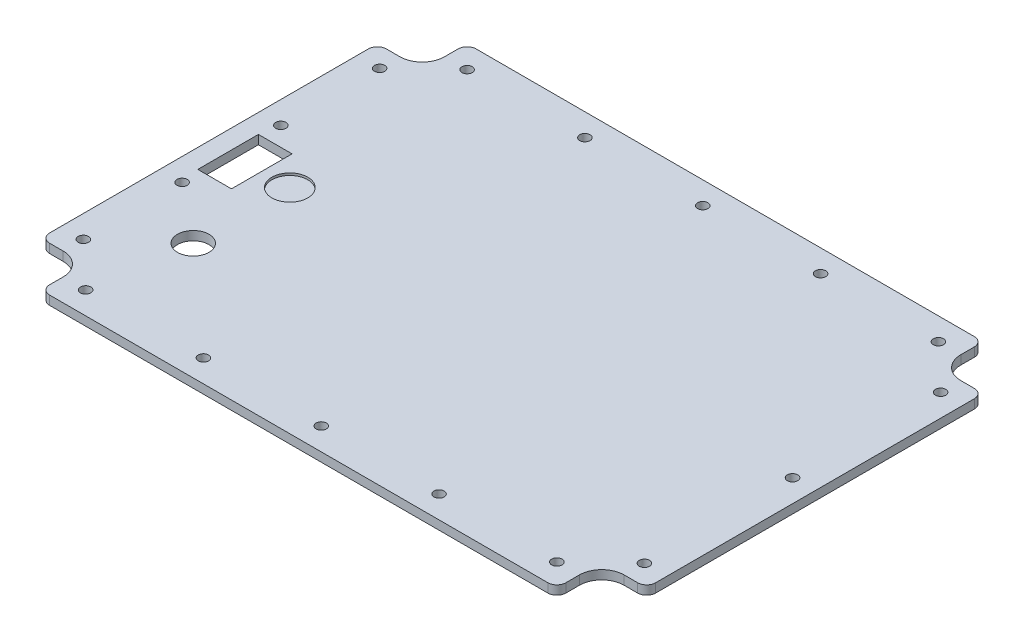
ISO-10303-21;
HEADER;
FILE_DESCRIPTION(('STEP AP214'),'2;1');
FILE_NAME('part.step','',(''),(''),'','','');
FILE_SCHEMA(('AUTOMOTIVE_DESIGN { 1 0 10303 214 1 1 1 1 }'));
ENDSEC;
DATA;
#1=APPLICATION_CONTEXT('core data for automotive mechanical design processes');
#2=APPLICATION_PROTOCOL_DEFINITION('international standard','automotive_design',2000,#1);
#3=PRODUCT_CONTEXT('',#1,'mechanical');
#4=PRODUCT('Part','Part','',(#3));
#5=PRODUCT_RELATED_PRODUCT_CATEGORY('part','',(#4));
#6=PRODUCT_DEFINITION_FORMATION('','',#4);
#7=PRODUCT_DEFINITION_CONTEXT('part definition',#1,'design');
#8=PRODUCT_DEFINITION('design','',#6,#7);
#9=PRODUCT_DEFINITION_SHAPE('','',#8);
#10=(LENGTH_UNIT() NAMED_UNIT(*) SI_UNIT(.MILLI.,.METRE.));
#11=(NAMED_UNIT(*) PLANE_ANGLE_UNIT() SI_UNIT($,.RADIAN.));
#12=(NAMED_UNIT(*) SI_UNIT($,.STERADIAN.) SOLID_ANGLE_UNIT());
#13=UNCERTAINTY_MEASURE_WITH_UNIT(LENGTH_MEASURE(1.E-05),#10,'distance_accuracy_value','');
#14=(GEOMETRIC_REPRESENTATION_CONTEXT(3) GLOBAL_UNCERTAINTY_ASSIGNED_CONTEXT((#13)) GLOBAL_UNIT_ASSIGNED_CONTEXT((#10,
#11,#12)) REPRESENTATION_CONTEXT('',''));
#15=CARTESIAN_POINT('',(0.,0.,0.));
#16=DIRECTION('',(0.,0.,1.));
#17=DIRECTION('',(1.,0.,0.));
#18=AXIS2_PLACEMENT_3D('',#15,#16,#17);
#19=CARTESIAN_POINT('',(-62.25,2.,-41.9273422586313));
#20=DIRECTION('',(0.,-1.,0.));
#21=DIRECTION('',(0.,0.,-1.));
#22=AXIS2_PLACEMENT_3D('',#19,#20,#21);
#23=PLANE('',#22);
#24=CARTESIAN_POINT('',(-49.2500000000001,2.,0.572657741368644));
#25=DIRECTION('',(0.,1.,0.));
#26=DIRECTION('',(0.,0.,1.));
#27=AXIS2_PLACEMENT_3D('',#24,#25,#26);
#28=CIRCLE('',#27,4.);
#29=CARTESIAN_POINT('',(-49.2500000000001,2.,4.57265774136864));
#30=VERTEX_POINT('',#29);
#31=EDGE_CURVE('E1095',#30,#30,#28,.T.);
#32=ORIENTED_EDGE('',*,*,#31,.F.);
#33=EDGE_LOOP('',(#32));
#34=FACE_BOUND('',#33,.T.);
#35=CARTESIAN_POINT('',(-49.2500000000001,2.,22.0926577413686));
#36=DIRECTION('',(0.,1.,0.));
#37=DIRECTION('',(0.,0.,1.));
#38=AXIS2_PLACEMENT_3D('',#35,#36,#37);
#39=CIRCLE('',#38,3.5);
#40=CARTESIAN_POINT('',(-49.2500000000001,2.,25.5926577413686));
#41=VERTEX_POINT('',#40);
#42=EDGE_CURVE('E255',#41,#41,#39,.T.);
#43=ORIENTED_EDGE('',*,*,#42,.F.);
#44=EDGE_LOOP('',(#43));
#45=FACE_BOUND('',#44,.T.);
#46=CARTESIAN_POINT('',(-26.,2.,-41.9273422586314));
#47=DIRECTION('',(0.,1.,0.));
#48=DIRECTION('',(0.,0.,1.));
#49=AXIS2_PLACEMENT_3D('',#46,#47,#48);
#50=CIRCLE('',#49,1.15);
#51=CARTESIAN_POINT('',(-26.,2.,-40.7773422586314));
#52=VERTEX_POINT('',#51);
#53=EDGE_CURVE('E267',#52,#52,#50,.T.);
#54=ORIENTED_EDGE('',*,*,#53,.F.);
#55=EDGE_LOOP('',(#54));
#56=FACE_BOUND('',#55,.T.);
#57=CARTESIAN_POINT('',(62.7500000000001,2.,33.5726577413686));
#58=DIRECTION('',(0.,1.,0.));
#59=DIRECTION('',(0.,0.,1.));
#60=AXIS2_PLACEMENT_3D('',#57,#58,#59);
#61=CIRCLE('',#60,1.15);
#62=CARTESIAN_POINT('',(62.7500000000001,2.,34.7226577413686));
#63=VERTEX_POINT('',#62);
#64=EDGE_CURVE('E279',#63,#63,#61,.T.);
#65=ORIENTED_EDGE('',*,*,#64,.F.);
#66=EDGE_LOOP('',(#65));
#67=FACE_BOUND('',#66,.T.);
#68=CARTESIAN_POINT('',(-62.25,2.,11.5726577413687));
#69=DIRECTION('',(0.,1.,0.));
#70=DIRECTION('',(0.,0.,-1.));
#71=AXIS2_PLACEMENT_3D('',#68,#69,#70);
#72=CIRCLE('',#71,1.15);
#73=CARTESIAN_POINT('',(-62.25,2.,10.4226577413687));
#74=VERTEX_POINT('',#73);
#75=EDGE_CURVE('E291',#74,#74,#72,.T.);
#76=ORIENTED_EDGE('',*,*,#75,.F.);
#77=EDGE_LOOP('',(#76));
#78=FACE_BOUND('',#77,.T.);
#79=CARTESIAN_POINT('',(-62.2500000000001,2.,-32.4273422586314));
#80=DIRECTION('',(0.,1.,0.));
#81=DIRECTION('',(0.,0.,1.));
#82=AXIS2_PLACEMENT_3D('',#79,#80,#81);
#83=CIRCLE('',#82,1.15);
#84=CARTESIAN_POINT('',(-62.2500000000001,2.,-31.2773422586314));
#85=VERTEX_POINT('',#84);
#86=EDGE_CURVE('E303',#85,#85,#83,.T.);
#87=ORIENTED_EDGE('',*,*,#86,.F.);
#88=EDGE_LOOP('',(#87));
#89=FACE_BOUND('',#88,.T.);
#90=CARTESIAN_POINT('',(52.75,2.,43.0726577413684));
#91=DIRECTION('',(0.,1.,0.));
#92=DIRECTION('',(0.,0.,1.));
#93=AXIS2_PLACEMENT_3D('',#90,#91,#92);
#94=CIRCLE('',#93,1.15);
#95=CARTESIAN_POINT('',(52.75,2.,44.2226577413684));
#96=VERTEX_POINT('',#95);
#97=EDGE_CURVE('E315',#96,#96,#94,.T.);
#98=ORIENTED_EDGE('',*,*,#97,.F.);
#99=EDGE_LOOP('',(#98));
#100=FACE_BOUND('',#99,.T.);
#101=CARTESIAN_POINT('',(-26.,2.,43.0726577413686));
#102=DIRECTION('',(0.,1.,0.));
#103=DIRECTION('',(0.,0.,-1.));
#104=AXIS2_PLACEMENT_3D('',#101,#102,#103);
#105=CIRCLE('',#104,1.15);
#106=CARTESIAN_POINT('',(-26.,2.,41.9226577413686));
#107=VERTEX_POINT('',#106);
#108=EDGE_CURVE('E327',#107,#107,#105,.T.);
#109=ORIENTED_EDGE('',*,*,#108,.F.);
#110=EDGE_LOOP('',(#109));
#111=FACE_BOUND('',#110,.T.);
#112=CARTESIAN_POINT('',(26.5,2.,-41.9273422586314));
#113=DIRECTION('',(0.,1.,0.));
#114=DIRECTION('',(0.,0.,-1.));
#115=AXIS2_PLACEMENT_3D('',#112,#113,#114);
#116=CIRCLE('',#115,1.15);
#117=CARTESIAN_POINT('',(26.5,2.,-43.0773422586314));
#118=VERTEX_POINT('',#117);
#119=EDGE_CURVE('E339',#118,#118,#116,.T.);
#120=ORIENTED_EDGE('',*,*,#119,.F.);
#121=EDGE_LOOP('',(#120));
#122=FACE_BOUND('',#121,.T.);
#123=CARTESIAN_POINT('',(62.75,2.,0.57265774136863));
#124=DIRECTION('',(0.,1.,0.));
#125=DIRECTION('',(0.,0.,1.));
#126=AXIS2_PLACEMENT_3D('',#123,#124,#125);
#127=CIRCLE('',#126,1.15);
#128=CARTESIAN_POINT('',(62.75,2.,1.72265774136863));
#129=VERTEX_POINT('',#128);
#130=EDGE_CURVE('E351',#129,#129,#127,.T.);
#131=ORIENTED_EDGE('',*,*,#130,.F.);
#132=EDGE_LOOP('',(#131));
#133=FACE_BOUND('',#132,.T.);
#134=CARTESIAN_POINT('',(-62.25,2.,-41.9273422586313));
#135=DIRECTION('',(0.,-1.,0.));
#136=DIRECTION('',(0.,0.,-1.));
#137=AXIS2_PLACEMENT_3D('',#134,#135,#136);
#138=CIRCLE('',#137,5.);
#139=CARTESIAN_POINT('',(-57.25,2.,-41.9273422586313));
#140=VERTEX_POINT('',#139);
#141=CARTESIAN_POINT('',(-62.25,2.,-36.9273422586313));
#142=VERTEX_POINT('',#141);
#143=EDGE_CURVE('E363',#140,#142,#138,.T.);
#144=ORIENTED_EDGE('',*,*,#143,.T.);
#145=DIRECTION('',(-1.,0.,0.));
#146=VECTOR('',#145,1.);
#147=CARTESIAN_POINT('',(-62.25,2.,-36.9273422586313));
#148=LINE('',#147,#146);
#149=CARTESIAN_POINT('',(-65.25,2.,-36.9273422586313));
#150=VERTEX_POINT('',#149);
#151=EDGE_CURVE('E366',#142,#150,#148,.T.);
#152=ORIENTED_EDGE('',*,*,#151,.T.);
#153=CARTESIAN_POINT('',(-65.25,2.,-34.9273422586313));
#154=DIRECTION('',(0.,1.,0.));
#155=DIRECTION('',(0.,0.,-1.));
#156=AXIS2_PLACEMENT_3D('',#153,#154,#155);
#157=CIRCLE('',#156,2.);
#158=CARTESIAN_POINT('',(-67.25,2.,-34.9273422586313));
#159=VERTEX_POINT('',#158);
#160=EDGE_CURVE('E369',#150,#159,#157,.T.);
#161=ORIENTED_EDGE('',*,*,#160,.T.);
#162=DIRECTION('',(0.,0.,1.));
#163=VECTOR('',#162,1.);
#164=CARTESIAN_POINT('',(-67.25,2.,36.0726577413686));
#165=LINE('',#164,#163);
#166=CARTESIAN_POINT('',(-67.25,2.,36.0726577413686));
#167=VERTEX_POINT('',#166);
#168=EDGE_CURVE('E371',#159,#167,#165,.T.);
#169=ORIENTED_EDGE('',*,*,#168,.T.);
#170=CARTESIAN_POINT('',(-65.25,2.,36.0726577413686));
#171=DIRECTION('',(0.,1.,0.));
#172=DIRECTION('',(0.,0.,1.));
#173=AXIS2_PLACEMENT_3D('',#170,#171,#172);
#174=CIRCLE('',#173,2.);
#175=CARTESIAN_POINT('',(-65.25,2.,38.0726577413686));
#176=VERTEX_POINT('',#175);
#177=EDGE_CURVE('E373',#167,#176,#174,.T.);
#178=ORIENTED_EDGE('',*,*,#177,.T.);
#179=DIRECTION('',(1.,0.,0.));
#180=VECTOR('',#179,1.);
#181=CARTESIAN_POINT('',(-62.25,2.,38.0726577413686));
#182=LINE('',#181,#180);
#183=CARTESIAN_POINT('',(-62.25,2.,38.0726577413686));
#184=VERTEX_POINT('',#183);
#185=EDGE_CURVE('E375',#176,#184,#182,.T.);
#186=ORIENTED_EDGE('',*,*,#185,.T.);
#187=CARTESIAN_POINT('',(-62.25,2.,43.0726577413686));
#188=DIRECTION('',(0.,-1.,0.));
#189=DIRECTION('',(0.,0.,1.));
#190=AXIS2_PLACEMENT_3D('',#187,#188,#189);
#191=CIRCLE('',#190,5.);
#192=CARTESIAN_POINT('',(-57.25,2.,43.0726577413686));
#193=VERTEX_POINT('',#192);
#194=EDGE_CURVE('E377',#184,#193,#191,.T.);
#195=ORIENTED_EDGE('',*,*,#194,.T.);
#196=DIRECTION('',(0.,0.,1.));
#197=VECTOR('',#196,1.);
#198=CARTESIAN_POINT('',(-57.25,2.,43.0726577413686));
#199=LINE('',#198,#197);
#200=CARTESIAN_POINT('',(-57.25,2.,46.0726577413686));
#201=VERTEX_POINT('',#200);
#202=EDGE_CURVE('E379',#193,#201,#199,.T.);
#203=ORIENTED_EDGE('',*,*,#202,.T.);
#204=CARTESIAN_POINT('',(-55.25,2.,46.0726577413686));
#205=DIRECTION('',(0.,1.,0.));
#206=DIRECTION('',(0.,0.,1.));
#207=AXIS2_PLACEMENT_3D('',#204,#205,#206);
#208=CIRCLE('',#207,2.00000000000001);
#209=CARTESIAN_POINT('',(-55.25,2.,48.0726577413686));
#210=VERTEX_POINT('',#209);
#211=EDGE_CURVE('E381',#201,#210,#208,.T.);
#212=ORIENTED_EDGE('',*,*,#211,.T.);
#213=DIRECTION('',(1.,0.,0.));
#214=VECTOR('',#213,1.);
#215=CARTESIAN_POINT('',(-55.25,2.,48.0726577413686));
#216=LINE('',#215,#214);
#217=CARTESIAN_POINT('',(55.75,2.,48.0726577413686));
#218=VERTEX_POINT('',#217);
#219=EDGE_CURVE('E383',#210,#218,#216,.T.);
#220=ORIENTED_EDGE('',*,*,#219,.T.);
#221=CARTESIAN_POINT('',(55.75,2.,46.0726577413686));
#222=DIRECTION('',(0.,1.,0.));
#223=DIRECTION('',(0.,0.,-1.));
#224=AXIS2_PLACEMENT_3D('',#221,#222,#223);
#225=CIRCLE('',#224,2.);
#226=CARTESIAN_POINT('',(57.75,2.,46.0726577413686));
#227=VERTEX_POINT('',#226);
#228=EDGE_CURVE('E385',#218,#227,#225,.T.);
#229=ORIENTED_EDGE('',*,*,#228,.T.);
#230=DIRECTION('',(0.,0.,-1.));
#231=VECTOR('',#230,1.);
#232=CARTESIAN_POINT('',(57.75,2.,43.0726577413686));
#233=LINE('',#232,#231);
#234=CARTESIAN_POINT('',(57.75,2.,43.0726577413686));
#235=VERTEX_POINT('',#234);
#236=EDGE_CURVE('E387',#227,#235,#233,.T.);
#237=ORIENTED_EDGE('',*,*,#236,.T.);
#238=CARTESIAN_POINT('',(62.75,2.,43.0726577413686));
#239=DIRECTION('',(0.,-1.,0.));
#240=DIRECTION('',(0.,0.,-1.));
#241=AXIS2_PLACEMENT_3D('',#238,#239,#240);
#242=CIRCLE('',#241,5.);
#243=CARTESIAN_POINT('',(62.75,2.,38.0726577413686));
#244=VERTEX_POINT('',#243);
#245=EDGE_CURVE('E389',#235,#244,#242,.T.);
#246=ORIENTED_EDGE('',*,*,#245,.T.);
#247=DIRECTION('',(1.,0.,0.));
#248=VECTOR('',#247,1.);
#249=CARTESIAN_POINT('',(62.75,2.,38.0726577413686));
#250=LINE('',#249,#248);
#251=CARTESIAN_POINT('',(65.75,2.,38.0726577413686));
#252=VERTEX_POINT('',#251);
#253=EDGE_CURVE('E391',#244,#252,#250,.T.);
#254=ORIENTED_EDGE('',*,*,#253,.T.);
#255=CARTESIAN_POINT('',(65.75,2.,36.0726577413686));
#256=DIRECTION('',(0.,1.,0.));
#257=DIRECTION('',(0.,0.,-1.));
#258=AXIS2_PLACEMENT_3D('',#255,#256,#257);
#259=CIRCLE('',#258,2.);
#260=CARTESIAN_POINT('',(67.75,2.,36.0726577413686));
#261=VERTEX_POINT('',#260);
#262=EDGE_CURVE('E393',#252,#261,#259,.T.);
#263=ORIENTED_EDGE('',*,*,#262,.T.);
#264=DIRECTION('',(0.,0.,-1.));
#265=VECTOR('',#264,1.);
#266=CARTESIAN_POINT('',(67.75,2.,36.0726577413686));
#267=LINE('',#266,#265);
#268=CARTESIAN_POINT('',(67.75,2.,-34.9273422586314));
#269=VERTEX_POINT('',#268);
#270=EDGE_CURVE('E395',#261,#269,#267,.T.);
#271=ORIENTED_EDGE('',*,*,#270,.T.);
#272=CARTESIAN_POINT('',(65.75,2.,-34.9273422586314));
#273=DIRECTION('',(0.,1.,0.));
#274=DIRECTION('',(0.,0.,-1.));
#275=AXIS2_PLACEMENT_3D('',#272,#273,#274);
#276=CIRCLE('',#275,2.);
#277=CARTESIAN_POINT('',(65.75,2.,-36.9273422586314));
#278=VERTEX_POINT('',#277);
#279=EDGE_CURVE('E397',#269,#278,#276,.T.);
#280=ORIENTED_EDGE('',*,*,#279,.T.);
#281=DIRECTION('',(-1.,0.,0.));
#282=VECTOR('',#281,1.);
#283=CARTESIAN_POINT('',(62.75,2.,-36.9273422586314));
#284=LINE('',#283,#282);
#285=CARTESIAN_POINT('',(62.75,2.,-36.9273422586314));
#286=VERTEX_POINT('',#285);
#287=EDGE_CURVE('E399',#278,#286,#284,.T.);
#288=ORIENTED_EDGE('',*,*,#287,.T.);
#289=CARTESIAN_POINT('',(62.75,2.,-41.9273422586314));
#290=DIRECTION('',(0.,-1.,0.));
#291=DIRECTION('',(0.,0.,1.));
#292=AXIS2_PLACEMENT_3D('',#289,#290,#291);
#293=CIRCLE('',#292,5.);
#294=CARTESIAN_POINT('',(57.75,2.,-41.9273422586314));
#295=VERTEX_POINT('',#294);
#296=EDGE_CURVE('E401',#286,#295,#293,.T.);
#297=ORIENTED_EDGE('',*,*,#296,.T.);
#298=DIRECTION('',(0.,0.,-1.));
#299=VECTOR('',#298,1.);
#300=CARTESIAN_POINT('',(57.75,2.,-41.9273422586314));
#301=LINE('',#300,#299);
#302=CARTESIAN_POINT('',(57.75,2.,-44.9273422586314));
#303=VERTEX_POINT('',#302);
#304=EDGE_CURVE('E403',#295,#303,#301,.T.);
#305=ORIENTED_EDGE('',*,*,#304,.T.);
#306=CARTESIAN_POINT('',(55.75,2.,-44.9273422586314));
#307=DIRECTION('',(0.,1.,0.));
#308=DIRECTION('',(0.,0.,-1.));
#309=AXIS2_PLACEMENT_3D('',#306,#307,#308);
#310=CIRCLE('',#309,2.);
#311=CARTESIAN_POINT('',(55.75,2.,-46.9273422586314));
#312=VERTEX_POINT('',#311);
#313=EDGE_CURVE('E405',#303,#312,#310,.T.);
#314=ORIENTED_EDGE('',*,*,#313,.T.);
#315=DIRECTION('',(-1.,0.,0.));
#316=VECTOR('',#315,1.);
#317=CARTESIAN_POINT('',(-55.25,2.,-46.9273422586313));
#318=LINE('',#317,#316);
#319=CARTESIAN_POINT('',(-55.25,2.,-46.9273422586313));
#320=VERTEX_POINT('',#319);
#321=EDGE_CURVE('E407',#312,#320,#318,.T.);
#322=ORIENTED_EDGE('',*,*,#321,.T.);
#323=CARTESIAN_POINT('',(-55.25,2.,-44.9273422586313));
#324=DIRECTION('',(0.,1.,0.));
#325=DIRECTION('',(0.,0.,-1.));
#326=AXIS2_PLACEMENT_3D('',#323,#324,#325);
#327=CIRCLE('',#326,2.);
#328=CARTESIAN_POINT('',(-57.25,2.,-44.9273422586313));
#329=VERTEX_POINT('',#328);
#330=EDGE_CURVE('E409',#320,#329,#327,.T.);
#331=ORIENTED_EDGE('',*,*,#330,.T.);
#332=DIRECTION('',(0.,0.,1.));
#333=VECTOR('',#332,1.);
#334=CARTESIAN_POINT('',(-57.25,2.,-41.9273422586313));
#335=LINE('',#334,#333);
#336=EDGE_CURVE('E411',#329,#140,#335,.T.);
#337=ORIENTED_EDGE('',*,*,#336,.T.);
#338=EDGE_LOOP('',(#144,#152,#161,#169,#178,#186,#195,#203,#212,#220,#229,#237,#246,#254,#263,
#271,#280,#288,#297,#305,#314,#322,#331,#337));
#339=FACE_BOUND('',#338,.T.);
#340=CARTESIAN_POINT('',(0.249999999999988,2.,-41.9273422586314));
#341=DIRECTION('',(0.,1.,0.));
#342=DIRECTION('',(0.,0.,1.));
#343=AXIS2_PLACEMENT_3D('',#340,#341,#342);
#344=CIRCLE('',#343,1.15);
#345=CARTESIAN_POINT('',(0.249999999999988,2.,-40.7773422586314));
#346=VERTEX_POINT('',#345);
#347=EDGE_CURVE('E357',#346,#346,#344,.T.);
#348=ORIENTED_EDGE('',*,*,#347,.F.);
#349=EDGE_LOOP('',(#348));
#350=FACE_BOUND('',#349,.T.);
#351=CARTESIAN_POINT('',(52.75,2.,-41.9273422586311));
#352=DIRECTION('',(0.,1.,0.));
#353=DIRECTION('',(0.,0.,-1.));
#354=AXIS2_PLACEMENT_3D('',#351,#352,#353);
#355=CIRCLE('',#354,1.15);
#356=CARTESIAN_POINT('',(52.75,2.,-43.0773422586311));
#357=VERTEX_POINT('',#356);
#358=EDGE_CURVE('E345',#357,#357,#355,.T.);
#359=ORIENTED_EDGE('',*,*,#358,.F.);
#360=EDGE_LOOP('',(#359));
#361=FACE_BOUND('',#360,.T.);
#362=CARTESIAN_POINT('',(-52.25,2.,43.0726577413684));
#363=DIRECTION('',(0.,1.,0.));
#364=DIRECTION('',(0.,0.,-1.));
#365=AXIS2_PLACEMENT_3D('',#362,#363,#364);
#366=CIRCLE('',#365,1.15);
#367=CARTESIAN_POINT('',(-52.25,2.,41.9226577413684));
#368=VERTEX_POINT('',#367);
#369=EDGE_CURVE('E333',#368,#368,#366,.T.);
#370=ORIENTED_EDGE('',*,*,#369,.F.);
#371=EDGE_LOOP('',(#370));
#372=FACE_BOUND('',#371,.T.);
#373=CARTESIAN_POINT('',(26.5,2.,43.0726577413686));
#374=DIRECTION('',(0.,1.,0.));
#375=DIRECTION('',(0.,0.,1.));
#376=AXIS2_PLACEMENT_3D('',#373,#374,#375);
#377=CIRCLE('',#376,1.15);
#378=CARTESIAN_POINT('',(26.5,2.,44.2226577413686));
#379=VERTEX_POINT('',#378);
#380=EDGE_CURVE('E321',#379,#379,#377,.T.);
#381=ORIENTED_EDGE('',*,*,#380,.F.);
#382=EDGE_LOOP('',(#381));
#383=FACE_BOUND('',#382,.T.);
#384=CARTESIAN_POINT('',(0.249999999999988,2.,43.0726577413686));
#385=DIRECTION('',(0.,1.,0.));
#386=DIRECTION('',(0.,0.,-1.));
#387=AXIS2_PLACEMENT_3D('',#384,#385,#386);
#388=CIRCLE('',#387,1.15);
#389=CARTESIAN_POINT('',(0.249999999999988,2.,41.9226577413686));
#390=VERTEX_POINT('',#389);
#391=EDGE_CURVE('E309',#390,#390,#388,.T.);
#392=ORIENTED_EDGE('',*,*,#391,.F.);
#393=EDGE_LOOP('',(#392));
#394=FACE_BOUND('',#393,.T.);
#395=CARTESIAN_POINT('',(-62.25,2.,-10.4273422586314));
#396=DIRECTION('',(0.,1.,0.));
#397=DIRECTION('',(0.,0.,1.));
#398=AXIS2_PLACEMENT_3D('',#395,#396,#397);
#399=CIRCLE('',#398,1.15);
#400=CARTESIAN_POINT('',(-62.25,2.,-9.27734225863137));
#401=VERTEX_POINT('',#400);
#402=EDGE_CURVE('E297',#401,#401,#399,.T.);
#403=ORIENTED_EDGE('',*,*,#402,.F.);
#404=EDGE_LOOP('',(#403));
#405=FACE_BOUND('',#404,.T.);
#406=CARTESIAN_POINT('',(-62.2500000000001,2.,33.5726577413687));
#407=DIRECTION('',(0.,1.,0.));
#408=DIRECTION('',(0.,0.,-1.));
#409=AXIS2_PLACEMENT_3D('',#406,#407,#408);
#410=CIRCLE('',#409,1.15);
#411=CARTESIAN_POINT('',(-62.2500000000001,2.,32.4226577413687));
#412=VERTEX_POINT('',#411);
#413=EDGE_CURVE('E285',#412,#412,#410,.T.);
#414=ORIENTED_EDGE('',*,*,#413,.F.);
#415=EDGE_LOOP('',(#414));
#416=FACE_BOUND('',#415,.T.);
#417=CARTESIAN_POINT('',(62.7500000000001,2.,-32.4273422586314));
#418=DIRECTION('',(0.,1.,0.));
#419=DIRECTION('',(0.,0.,-1.));
#420=AXIS2_PLACEMENT_3D('',#417,#418,#419);
#421=CIRCLE('',#420,1.15);
#422=CARTESIAN_POINT('',(62.7500000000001,2.,-33.5773422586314));
#423=VERTEX_POINT('',#422);
#424=EDGE_CURVE('E273',#423,#423,#421,.T.);
#425=ORIENTED_EDGE('',*,*,#424,.F.);
#426=EDGE_LOOP('',(#425));
#427=FACE_BOUND('',#426,.T.);
#428=CARTESIAN_POINT('',(-52.25,2.,-41.9273422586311));
#429=DIRECTION('',(0.,1.,0.));
#430=DIRECTION('',(0.,0.,1.));
#431=AXIS2_PLACEMENT_3D('',#428,#429,#430);
#432=CIRCLE('',#431,1.15);
#433=CARTESIAN_POINT('',(-52.25,2.,-40.7773422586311));
#434=VERTEX_POINT('',#433);
#435=EDGE_CURVE('E261',#434,#434,#432,.T.);
#436=ORIENTED_EDGE('',*,*,#435,.F.);
#437=EDGE_LOOP('',(#436));
#438=FACE_BOUND('',#437,.T.);
#439=DIRECTION('',(0.,0.,-1.));
#440=VECTOR('',#439,1.);
#441=CARTESIAN_POINT('',(-55.5,2.,7.32265774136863));
#442=LINE('',#441,#440);
#443=CARTESIAN_POINT('',(-55.5,2.,7.32265774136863));
#444=VERTEX_POINT('',#443);
#445=CARTESIAN_POINT('',(-55.5,2.,-6.17734225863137));
#446=VERTEX_POINT('',#445);
#447=EDGE_CURVE('E217',#444,#446,#442,.T.);
#448=ORIENTED_EDGE('',*,*,#447,.F.);
#449=DIRECTION('',(1.,0.,0.));
#450=VECTOR('',#449,1.);
#451=CARTESIAN_POINT('',(-63.,2.,7.32265774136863));
#452=LINE('',#451,#450);
#453=CARTESIAN_POINT('',(-63.,2.,7.32265774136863));
#454=VERTEX_POINT('',#453);
#455=EDGE_CURVE('E239',#454,#444,#452,.T.);
#456=ORIENTED_EDGE('',*,*,#455,.F.);
#457=DIRECTION('',(0.,0.,1.));
#458=VECTOR('',#457,1.);
#459=CARTESIAN_POINT('',(-63.,2.,7.32265774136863));
#460=LINE('',#459,#458);
#461=CARTESIAN_POINT('',(-63.,2.,-6.17734225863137));
#462=VERTEX_POINT('',#461);
#463=EDGE_CURVE('E237',#462,#454,#460,.T.);
#464=ORIENTED_EDGE('',*,*,#463,.F.);
#465=DIRECTION('',(-1.,0.,0.));
#466=VECTOR('',#465,1.);
#467=CARTESIAN_POINT('',(-63.,2.,-6.17734225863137));
#468=LINE('',#467,#466);
#469=EDGE_CURVE('E225',#446,#462,#468,.T.);
#470=ORIENTED_EDGE('',*,*,#469,.F.);
#471=EDGE_LOOP('',(#448,#456,#464,#470));
#472=FACE_BOUND('',#471,.T.);
#473=ADVANCED_FACE('F32',(#34,#45,#56,#67,#78,#89,#100,#111,#122,#133,#339,#350,#361,#372,#383,
#394,#405,#416,#427,#438,#472),#23,.F.);
#474=CARTESIAN_POINT('',(-62.25,0.,-41.9273422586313));
#475=DIRECTION('',(0.,-1.,0.));
#476=DIRECTION('',(0.,0.,-1.));
#477=AXIS2_PLACEMENT_3D('',#474,#475,#476);
#478=PLANE('',#477);
#479=CARTESIAN_POINT('',(-49.2500000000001,0.,22.0926577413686));
#480=DIRECTION('',(0.,1.,0.));
#481=DIRECTION('',(0.,0.,1.));
#482=AXIS2_PLACEMENT_3D('',#479,#480,#481);
#483=CIRCLE('',#482,3.5);
#484=CARTESIAN_POINT('',(-49.2500000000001,0.,25.5926577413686));
#485=VERTEX_POINT('',#484);
#486=EDGE_CURVE('E233',#485,#485,#483,.T.);
#487=ORIENTED_EDGE('',*,*,#486,.T.);
#488=EDGE_LOOP('',(#487));
#489=FACE_BOUND('',#488,.T.);
#490=CARTESIAN_POINT('',(-26.,0.,-41.9273422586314));
#491=DIRECTION('',(0.,1.,0.));
#492=DIRECTION('',(0.,0.,1.));
#493=AXIS2_PLACEMENT_3D('',#490,#491,#492);
#494=CIRCLE('',#493,1.15);
#495=CARTESIAN_POINT('',(-26.,0.,-40.7773422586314));
#496=VERTEX_POINT('',#495);
#497=EDGE_CURVE('E264',#496,#496,#494,.T.);
#498=ORIENTED_EDGE('',*,*,#497,.T.);
#499=EDGE_LOOP('',(#498));
#500=FACE_BOUND('',#499,.T.);
#501=CARTESIAN_POINT('',(62.7500000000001,0.,33.5726577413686));
#502=DIRECTION('',(0.,1.,0.));
#503=DIRECTION('',(0.,0.,1.));
#504=AXIS2_PLACEMENT_3D('',#501,#502,#503);
#505=CIRCLE('',#504,1.15);
#506=CARTESIAN_POINT('',(62.7500000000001,0.,34.7226577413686));
#507=VERTEX_POINT('',#506);
#508=EDGE_CURVE('E276',#507,#507,#505,.T.);
#509=ORIENTED_EDGE('',*,*,#508,.T.);
#510=EDGE_LOOP('',(#509));
#511=FACE_BOUND('',#510,.T.);
#512=CARTESIAN_POINT('',(-62.25,0.,11.5726577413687));
#513=DIRECTION('',(0.,1.,0.));
#514=DIRECTION('',(0.,0.,-1.));
#515=AXIS2_PLACEMENT_3D('',#512,#513,#514);
#516=CIRCLE('',#515,1.15);
#517=CARTESIAN_POINT('',(-62.25,0.,10.4226577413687));
#518=VERTEX_POINT('',#517);
#519=EDGE_CURVE('E288',#518,#518,#516,.T.);
#520=ORIENTED_EDGE('',*,*,#519,.T.);
#521=EDGE_LOOP('',(#520));
#522=FACE_BOUND('',#521,.T.);
#523=CARTESIAN_POINT('',(-62.2500000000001,0.,-32.4273422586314));
#524=DIRECTION('',(0.,1.,0.));
#525=DIRECTION('',(0.,0.,1.));
#526=AXIS2_PLACEMENT_3D('',#523,#524,#525);
#527=CIRCLE('',#526,1.15);
#528=CARTESIAN_POINT('',(-62.2500000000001,0.,-31.2773422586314));
#529=VERTEX_POINT('',#528);
#530=EDGE_CURVE('E300',#529,#529,#527,.T.);
#531=ORIENTED_EDGE('',*,*,#530,.T.);
#532=EDGE_LOOP('',(#531));
#533=FACE_BOUND('',#532,.T.);
#534=CARTESIAN_POINT('',(52.75,0.,43.0726577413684));
#535=DIRECTION('',(0.,1.,0.));
#536=DIRECTION('',(0.,0.,1.));
#537=AXIS2_PLACEMENT_3D('',#534,#535,#536);
#538=CIRCLE('',#537,1.15);
#539=CARTESIAN_POINT('',(52.75,0.,44.2226577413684));
#540=VERTEX_POINT('',#539);
#541=EDGE_CURVE('E312',#540,#540,#538,.T.);
#542=ORIENTED_EDGE('',*,*,#541,.T.);
#543=EDGE_LOOP('',(#542));
#544=FACE_BOUND('',#543,.T.);
#545=CARTESIAN_POINT('',(-26.,0.,43.0726577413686));
#546=DIRECTION('',(0.,1.,0.));
#547=DIRECTION('',(0.,0.,-1.));
#548=AXIS2_PLACEMENT_3D('',#545,#546,#547);
#549=CIRCLE('',#548,1.15);
#550=CARTESIAN_POINT('',(-26.,0.,41.9226577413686));
#551=VERTEX_POINT('',#550);
#552=EDGE_CURVE('E324',#551,#551,#549,.T.);
#553=ORIENTED_EDGE('',*,*,#552,.T.);
#554=EDGE_LOOP('',(#553));
#555=FACE_BOUND('',#554,.T.);
#556=CARTESIAN_POINT('',(26.5,0.,-41.9273422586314));
#557=DIRECTION('',(0.,1.,0.));
#558=DIRECTION('',(0.,0.,-1.));
#559=AXIS2_PLACEMENT_3D('',#556,#557,#558);
#560=CIRCLE('',#559,1.15);
#561=CARTESIAN_POINT('',(26.5,0.,-43.0773422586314));
#562=VERTEX_POINT('',#561);
#563=EDGE_CURVE('E336',#562,#562,#560,.T.);
#564=ORIENTED_EDGE('',*,*,#563,.T.);
#565=EDGE_LOOP('',(#564));
#566=FACE_BOUND('',#565,.T.);
#567=CARTESIAN_POINT('',(62.75,0.,0.57265774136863));
#568=DIRECTION('',(0.,1.,0.));
#569=DIRECTION('',(0.,0.,1.));
#570=AXIS2_PLACEMENT_3D('',#567,#568,#569);
#571=CIRCLE('',#570,1.15);
#572=CARTESIAN_POINT('',(62.75,0.,1.72265774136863));
#573=VERTEX_POINT('',#572);
#574=EDGE_CURVE('E348',#573,#573,#571,.T.);
#575=ORIENTED_EDGE('',*,*,#574,.T.);
#576=EDGE_LOOP('',(#575));
#577=FACE_BOUND('',#576,.T.);
#578=CARTESIAN_POINT('',(-62.25,0.,-41.9273422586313));
#579=DIRECTION('',(0.,-1.,0.));
#580=DIRECTION('',(0.,0.,-1.));
#581=AXIS2_PLACEMENT_3D('',#578,#579,#580);
#582=CIRCLE('',#581,5.);
#583=CARTESIAN_POINT('',(-57.25,0.,-41.9273422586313));
#584=VERTEX_POINT('',#583);
#585=CARTESIAN_POINT('',(-62.25,0.,-36.9273422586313));
#586=VERTEX_POINT('',#585);
#587=EDGE_CURVE('E360',#584,#586,#582,.T.);
#588=ORIENTED_EDGE('',*,*,#587,.F.);
#589=DIRECTION('',(0.,0.,1.));
#590=VECTOR('',#589,1.);
#591=CARTESIAN_POINT('',(-57.25,0.,-41.9273422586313));
#592=LINE('',#591,#590);
#593=CARTESIAN_POINT('',(-57.25,0.,-44.9273422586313));
#594=VERTEX_POINT('',#593);
#595=EDGE_CURVE('E367',#594,#584,#592,.T.);
#596=ORIENTED_EDGE('',*,*,#595,.F.);
#597=CARTESIAN_POINT('',(-55.25,0.,-44.9273422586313));
#598=DIRECTION('',(0.,1.,0.));
#599=DIRECTION('',(0.,0.,-1.));
#600=AXIS2_PLACEMENT_3D('',#597,#598,#599);
#601=CIRCLE('',#600,2.);
#602=CARTESIAN_POINT('',(-55.25,0.,-46.9273422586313));
#603=VERTEX_POINT('',#602);
#604=EDGE_CURVE('E458',#603,#594,#601,.T.);
#605=ORIENTED_EDGE('',*,*,#604,.F.);
#606=DIRECTION('',(-1.,0.,0.));
#607=VECTOR('',#606,1.);
#608=CARTESIAN_POINT('',(-55.25,0.,-46.9273422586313));
#609=LINE('',#608,#607);
#610=CARTESIAN_POINT('',(55.75,0.,-46.9273422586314));
#611=VERTEX_POINT('',#610);
#612=EDGE_CURVE('E456',#611,#603,#609,.T.);
#613=ORIENTED_EDGE('',*,*,#612,.F.);
#614=CARTESIAN_POINT('',(55.75,0.,-44.9273422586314));
#615=DIRECTION('',(0.,1.,0.));
#616=DIRECTION('',(0.,0.,-1.));
#617=AXIS2_PLACEMENT_3D('',#614,#615,#616);
#618=CIRCLE('',#617,2.);
#619=CARTESIAN_POINT('',(57.75,0.,-44.9273422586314));
#620=VERTEX_POINT('',#619);
#621=EDGE_CURVE('E454',#620,#611,#618,.T.);
#622=ORIENTED_EDGE('',*,*,#621,.F.);
#623=DIRECTION('',(0.,0.,-1.));
#624=VECTOR('',#623,1.);
#625=CARTESIAN_POINT('',(57.75,0.,-41.9273422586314));
#626=LINE('',#625,#624);
#627=CARTESIAN_POINT('',(57.75,0.,-41.9273422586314));
#628=VERTEX_POINT('',#627);
#629=EDGE_CURVE('E452',#628,#620,#626,.T.);
#630=ORIENTED_EDGE('',*,*,#629,.F.);
#631=CARTESIAN_POINT('',(62.75,0.,-41.9273422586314));
#632=DIRECTION('',(0.,-1.,0.));
#633=DIRECTION('',(0.,0.,1.));
#634=AXIS2_PLACEMENT_3D('',#631,#632,#633);
#635=CIRCLE('',#634,5.);
#636=CARTESIAN_POINT('',(62.75,0.,-36.9273422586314));
#637=VERTEX_POINT('',#636);
#638=EDGE_CURVE('E450',#637,#628,#635,.T.);
#639=ORIENTED_EDGE('',*,*,#638,.F.);
#640=DIRECTION('',(-1.,0.,0.));
#641=VECTOR('',#640,1.);
#642=CARTESIAN_POINT('',(62.75,0.,-36.9273422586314));
#643=LINE('',#642,#641);
#644=CARTESIAN_POINT('',(65.75,0.,-36.9273422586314));
#645=VERTEX_POINT('',#644);
#646=EDGE_CURVE('E448',#645,#637,#643,.T.);
#647=ORIENTED_EDGE('',*,*,#646,.F.);
#648=CARTESIAN_POINT('',(65.75,0.,-34.9273422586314));
#649=DIRECTION('',(0.,1.,0.));
#650=DIRECTION('',(0.,0.,-1.));
#651=AXIS2_PLACEMENT_3D('',#648,#649,#650);
#652=CIRCLE('',#651,2.);
#653=CARTESIAN_POINT('',(67.75,0.,-34.9273422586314));
#654=VERTEX_POINT('',#653);
#655=EDGE_CURVE('E446',#654,#645,#652,.T.);
#656=ORIENTED_EDGE('',*,*,#655,.F.);
#657=DIRECTION('',(0.,0.,-1.));
#658=VECTOR('',#657,1.);
#659=CARTESIAN_POINT('',(67.75,0.,36.0726577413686));
#660=LINE('',#659,#658);
#661=CARTESIAN_POINT('',(67.75,0.,36.0726577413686));
#662=VERTEX_POINT('',#661);
#663=EDGE_CURVE('E444',#662,#654,#660,.T.);
#664=ORIENTED_EDGE('',*,*,#663,.F.);
#665=CARTESIAN_POINT('',(65.75,0.,36.0726577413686));
#666=DIRECTION('',(0.,1.,0.));
#667=DIRECTION('',(0.,0.,-1.));
#668=AXIS2_PLACEMENT_3D('',#665,#666,#667);
#669=CIRCLE('',#668,2.);
#670=CARTESIAN_POINT('',(65.75,0.,38.0726577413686));
#671=VERTEX_POINT('',#670);
#672=EDGE_CURVE('E442',#671,#662,#669,.T.);
#673=ORIENTED_EDGE('',*,*,#672,.F.);
#674=DIRECTION('',(1.,0.,0.));
#675=VECTOR('',#674,1.);
#676=CARTESIAN_POINT('',(62.75,0.,38.0726577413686));
#677=LINE('',#676,#675);
#678=CARTESIAN_POINT('',(62.75,0.,38.0726577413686));
#679=VERTEX_POINT('',#678);
#680=EDGE_CURVE('E440',#679,#671,#677,.T.);
#681=ORIENTED_EDGE('',*,*,#680,.F.);
#682=CARTESIAN_POINT('',(62.75,0.,43.0726577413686));
#683=DIRECTION('',(0.,-1.,0.));
#684=DIRECTION('',(0.,0.,-1.));
#685=AXIS2_PLACEMENT_3D('',#682,#683,#684);
#686=CIRCLE('',#685,5.);
#687=CARTESIAN_POINT('',(57.75,0.,43.0726577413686));
#688=VERTEX_POINT('',#687);
#689=EDGE_CURVE('E438',#688,#679,#686,.T.);
#690=ORIENTED_EDGE('',*,*,#689,.F.);
#691=DIRECTION('',(0.,0.,-1.));
#692=VECTOR('',#691,1.);
#693=CARTESIAN_POINT('',(57.75,0.,43.0726577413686));
#694=LINE('',#693,#692);
#695=CARTESIAN_POINT('',(57.75,0.,46.0726577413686));
#696=VERTEX_POINT('',#695);
#697=EDGE_CURVE('E436',#696,#688,#694,.T.);
#698=ORIENTED_EDGE('',*,*,#697,.F.);
#699=CARTESIAN_POINT('',(55.75,0.,46.0726577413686));
#700=DIRECTION('',(0.,1.,0.));
#701=DIRECTION('',(0.,0.,-1.));
#702=AXIS2_PLACEMENT_3D('',#699,#700,#701);
#703=CIRCLE('',#702,2.);
#704=CARTESIAN_POINT('',(55.75,0.,48.0726577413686));
#705=VERTEX_POINT('',#704);
#706=EDGE_CURVE('E434',#705,#696,#703,.T.);
#707=ORIENTED_EDGE('',*,*,#706,.F.);
#708=DIRECTION('',(1.,0.,0.));
#709=VECTOR('',#708,1.);
#710=CARTESIAN_POINT('',(-55.25,0.,48.0726577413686));
#711=LINE('',#710,#709);
#712=CARTESIAN_POINT('',(-55.25,0.,48.0726577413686));
#713=VERTEX_POINT('',#712);
#714=EDGE_CURVE('E432',#713,#705,#711,.T.);
#715=ORIENTED_EDGE('',*,*,#714,.F.);
#716=CARTESIAN_POINT('',(-55.25,0.,46.0726577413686));
#717=DIRECTION('',(0.,1.,0.));
#718=DIRECTION('',(0.,0.,1.));
#719=AXIS2_PLACEMENT_3D('',#716,#717,#718);
#720=CIRCLE('',#719,2.00000000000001);
#721=CARTESIAN_POINT('',(-57.25,0.,46.0726577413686));
#722=VERTEX_POINT('',#721);
#723=EDGE_CURVE('E430',#722,#713,#720,.T.);
#724=ORIENTED_EDGE('',*,*,#723,.F.);
#725=DIRECTION('',(0.,0.,1.));
#726=VECTOR('',#725,1.);
#727=CARTESIAN_POINT('',(-57.25,0.,43.0726577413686));
#728=LINE('',#727,#726);
#729=CARTESIAN_POINT('',(-57.25,0.,43.0726577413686));
#730=VERTEX_POINT('',#729);
#731=EDGE_CURVE('E428',#730,#722,#728,.T.);
#732=ORIENTED_EDGE('',*,*,#731,.F.);
#733=CARTESIAN_POINT('',(-62.25,0.,43.0726577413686));
#734=DIRECTION('',(0.,-1.,0.));
#735=DIRECTION('',(0.,0.,1.));
#736=AXIS2_PLACEMENT_3D('',#733,#734,#735);
#737=CIRCLE('',#736,5.);
#738=CARTESIAN_POINT('',(-62.25,0.,38.0726577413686));
#739=VERTEX_POINT('',#738);
#740=EDGE_CURVE('E426',#739,#730,#737,.T.);
#741=ORIENTED_EDGE('',*,*,#740,.F.);
#742=DIRECTION('',(1.,0.,0.));
#743=VECTOR('',#742,1.);
#744=CARTESIAN_POINT('',(-62.25,0.,38.0726577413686));
#745=LINE('',#744,#743);
#746=CARTESIAN_POINT('',(-65.25,0.,38.0726577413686));
#747=VERTEX_POINT('',#746);
#748=EDGE_CURVE('E424',#747,#739,#745,.T.);
#749=ORIENTED_EDGE('',*,*,#748,.F.);
#750=CARTESIAN_POINT('',(-65.25,0.,36.0726577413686));
#751=DIRECTION('',(0.,1.,0.));
#752=DIRECTION('',(0.,0.,1.));
#753=AXIS2_PLACEMENT_3D('',#750,#751,#752);
#754=CIRCLE('',#753,2.);
#755=CARTESIAN_POINT('',(-67.25,0.,36.0726577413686));
#756=VERTEX_POINT('',#755);
#757=EDGE_CURVE('E422',#756,#747,#754,.T.);
#758=ORIENTED_EDGE('',*,*,#757,.F.);
#759=DIRECTION('',(0.,0.,1.));
#760=VECTOR('',#759,1.);
#761=CARTESIAN_POINT('',(-67.25,0.,36.0726577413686));
#762=LINE('',#761,#760);
#763=CARTESIAN_POINT('',(-67.25,0.,-34.9273422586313));
#764=VERTEX_POINT('',#763);
#765=EDGE_CURVE('E420',#764,#756,#762,.T.);
#766=ORIENTED_EDGE('',*,*,#765,.F.);
#767=CARTESIAN_POINT('',(-65.25,0.,-34.9273422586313));
#768=DIRECTION('',(0.,1.,0.));
#769=DIRECTION('',(0.,0.,-1.));
#770=AXIS2_PLACEMENT_3D('',#767,#768,#769);
#771=CIRCLE('',#770,2.);
#772=CARTESIAN_POINT('',(-65.25,0.,-36.9273422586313));
#773=VERTEX_POINT('',#772);
#774=EDGE_CURVE('E418',#773,#764,#771,.T.);
#775=ORIENTED_EDGE('',*,*,#774,.F.);
#776=DIRECTION('',(-1.,0.,0.));
#777=VECTOR('',#776,1.);
#778=CARTESIAN_POINT('',(-62.25,0.,-36.9273422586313));
#779=LINE('',#778,#777);
#780=EDGE_CURVE('E416',#586,#773,#779,.T.);
#781=ORIENTED_EDGE('',*,*,#780,.F.);
#782=EDGE_LOOP('',(#588,#596,#605,#613,#622,#630,#639,#647,#656,#664,#673,#681,#690,#698,#707,
#715,#724,#732,#741,#749,#758,#766,#775,#781));
#783=FACE_BOUND('',#782,.T.);
#784=CARTESIAN_POINT('',(0.249999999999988,0.,-41.9273422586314));
#785=DIRECTION('',(0.,1.,0.));
#786=DIRECTION('',(0.,0.,1.));
#787=AXIS2_PLACEMENT_3D('',#784,#785,#786);
#788=CIRCLE('',#787,1.15);
#789=CARTESIAN_POINT('',(0.249999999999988,0.,-40.7773422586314));
#790=VERTEX_POINT('',#789);
#791=EDGE_CURVE('E354',#790,#790,#788,.T.);
#792=ORIENTED_EDGE('',*,*,#791,.T.);
#793=EDGE_LOOP('',(#792));
#794=FACE_BOUND('',#793,.T.);
#795=CARTESIAN_POINT('',(52.75,0.,-41.9273422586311));
#796=DIRECTION('',(0.,1.,0.));
#797=DIRECTION('',(0.,0.,-1.));
#798=AXIS2_PLACEMENT_3D('',#795,#796,#797);
#799=CIRCLE('',#798,1.15);
#800=CARTESIAN_POINT('',(52.75,0.,-43.0773422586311));
#801=VERTEX_POINT('',#800);
#802=EDGE_CURVE('E342',#801,#801,#799,.T.);
#803=ORIENTED_EDGE('',*,*,#802,.T.);
#804=EDGE_LOOP('',(#803));
#805=FACE_BOUND('',#804,.T.);
#806=CARTESIAN_POINT('',(-52.25,0.,43.0726577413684));
#807=DIRECTION('',(0.,1.,0.));
#808=DIRECTION('',(0.,0.,-1.));
#809=AXIS2_PLACEMENT_3D('',#806,#807,#808);
#810=CIRCLE('',#809,1.15);
#811=CARTESIAN_POINT('',(-52.25,0.,41.9226577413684));
#812=VERTEX_POINT('',#811);
#813=EDGE_CURVE('E330',#812,#812,#810,.T.);
#814=ORIENTED_EDGE('',*,*,#813,.T.);
#815=EDGE_LOOP('',(#814));
#816=FACE_BOUND('',#815,.T.);
#817=CARTESIAN_POINT('',(26.5,0.,43.0726577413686));
#818=DIRECTION('',(0.,1.,0.));
#819=DIRECTION('',(0.,0.,1.));
#820=AXIS2_PLACEMENT_3D('',#817,#818,#819);
#821=CIRCLE('',#820,1.15);
#822=CARTESIAN_POINT('',(26.5,0.,44.2226577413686));
#823=VERTEX_POINT('',#822);
#824=EDGE_CURVE('E318',#823,#823,#821,.T.);
#825=ORIENTED_EDGE('',*,*,#824,.T.);
#826=EDGE_LOOP('',(#825));
#827=FACE_BOUND('',#826,.T.);
#828=CARTESIAN_POINT('',(0.249999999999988,0.,43.0726577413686));
#829=DIRECTION('',(0.,1.,0.));
#830=DIRECTION('',(0.,0.,-1.));
#831=AXIS2_PLACEMENT_3D('',#828,#829,#830);
#832=CIRCLE('',#831,1.15);
#833=CARTESIAN_POINT('',(0.249999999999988,0.,41.9226577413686));
#834=VERTEX_POINT('',#833);
#835=EDGE_CURVE('E306',#834,#834,#832,.T.);
#836=ORIENTED_EDGE('',*,*,#835,.T.);
#837=EDGE_LOOP('',(#836));
#838=FACE_BOUND('',#837,.T.);
#839=CARTESIAN_POINT('',(-62.25,0.,-10.4273422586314));
#840=DIRECTION('',(0.,1.,0.));
#841=DIRECTION('',(0.,0.,1.));
#842=AXIS2_PLACEMENT_3D('',#839,#840,#841);
#843=CIRCLE('',#842,1.15);
#844=CARTESIAN_POINT('',(-62.25,0.,-9.27734225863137));
#845=VERTEX_POINT('',#844);
#846=EDGE_CURVE('E294',#845,#845,#843,.T.);
#847=ORIENTED_EDGE('',*,*,#846,.T.);
#848=EDGE_LOOP('',(#847));
#849=FACE_BOUND('',#848,.T.);
#850=CARTESIAN_POINT('',(-62.2500000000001,0.,33.5726577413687));
#851=DIRECTION('',(0.,1.,0.));
#852=DIRECTION('',(0.,0.,-1.));
#853=AXIS2_PLACEMENT_3D('',#850,#851,#852);
#854=CIRCLE('',#853,1.15);
#855=CARTESIAN_POINT('',(-62.2500000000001,0.,32.4226577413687));
#856=VERTEX_POINT('',#855);
#857=EDGE_CURVE('E282',#856,#856,#854,.T.);
#858=ORIENTED_EDGE('',*,*,#857,.T.);
#859=EDGE_LOOP('',(#858));
#860=FACE_BOUND('',#859,.T.);
#861=CARTESIAN_POINT('',(62.7500000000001,0.,-32.4273422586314));
#862=DIRECTION('',(0.,1.,0.));
#863=DIRECTION('',(0.,0.,-1.));
#864=AXIS2_PLACEMENT_3D('',#861,#862,#863);
#865=CIRCLE('',#864,1.15);
#866=CARTESIAN_POINT('',(62.7500000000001,0.,-33.5773422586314));
#867=VERTEX_POINT('',#866);
#868=EDGE_CURVE('E270',#867,#867,#865,.T.);
#869=ORIENTED_EDGE('',*,*,#868,.T.);
#870=EDGE_LOOP('',(#869));
#871=FACE_BOUND('',#870,.T.);
#872=CARTESIAN_POINT('',(-52.25,0.,-41.9273422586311));
#873=DIRECTION('',(0.,1.,0.));
#874=DIRECTION('',(0.,0.,1.));
#875=AXIS2_PLACEMENT_3D('',#872,#873,#874);
#876=CIRCLE('',#875,1.15);
#877=CARTESIAN_POINT('',(-52.25,0.,-40.7773422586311));
#878=VERTEX_POINT('',#877);
#879=EDGE_CURVE('E258',#878,#878,#876,.T.);
#880=ORIENTED_EDGE('',*,*,#879,.T.);
#881=EDGE_LOOP('',(#880));
#882=FACE_BOUND('',#881,.T.);
#883=DIRECTION('',(1.,0.,0.));
#884=VECTOR('',#883,1.);
#885=CARTESIAN_POINT('',(-63.,0.,7.32265774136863));
#886=LINE('',#885,#884);
#887=CARTESIAN_POINT('',(-63.,0.,7.32265774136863));
#888=VERTEX_POINT('',#887);
#889=CARTESIAN_POINT('',(-55.5,0.,7.32265774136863));
#890=VERTEX_POINT('',#889);
#891=EDGE_CURVE('E226',#888,#890,#886,.T.);
#892=ORIENTED_EDGE('',*,*,#891,.T.);
#893=DIRECTION('',(0.,0.,-1.));
#894=VECTOR('',#893,1.);
#895=CARTESIAN_POINT('',(-55.5,0.,7.32265774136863));
#896=LINE('',#895,#894);
#897=CARTESIAN_POINT('',(-55.5,0.,-6.17734225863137));
#898=VERTEX_POINT('',#897);
#899=EDGE_CURVE('E55',#890,#898,#896,.T.);
#900=ORIENTED_EDGE('',*,*,#899,.T.);
#901=DIRECTION('',(-1.,0.,0.));
#902=VECTOR('',#901,1.);
#903=CARTESIAN_POINT('',(-63.,0.,-6.17734225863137));
#904=LINE('',#903,#902);
#905=CARTESIAN_POINT('',(-63.,0.,-6.17734225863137));
#906=VERTEX_POINT('',#905);
#907=EDGE_CURVE('E232',#898,#906,#904,.T.);
#908=ORIENTED_EDGE('',*,*,#907,.T.);
#909=DIRECTION('',(0.,0.,1.));
#910=VECTOR('',#909,1.);
#911=CARTESIAN_POINT('',(-63.,0.,7.32265774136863));
#912=LINE('',#911,#910);
#913=EDGE_CURVE('E247',#906,#888,#912,.T.);
#914=ORIENTED_EDGE('',*,*,#913,.T.);
#915=EDGE_LOOP('',(#892,#900,#908,#914));
#916=FACE_BOUND('',#915,.T.);
#917=ADVANCED_FACE('F536',(#489,#500,#511,#522,#533,#544,#555,#566,#577,#783,#794,#805,#816,
#827,#838,#849,#860,#871,#882,#916),#478,.T.);
#918=CARTESIAN_POINT('',(-62.25,2.,-41.9273422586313));
#919=DIRECTION('',(0.,-1.,0.));
#920=DIRECTION('',(0.,0.,-1.));
#921=AXIS2_PLACEMENT_3D('',#918,#919,#920);
#922=CYLINDRICAL_SURFACE('',#921,5.);
#923=ORIENTED_EDGE('',*,*,#587,.T.);
#924=DIRECTION('',(0.,-1.,0.));
#925=VECTOR('',#924,1.);
#926=CARTESIAN_POINT('',(-62.25,2.,-36.9273422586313));
#927=LINE('',#926,#925);
#928=EDGE_CURVE('E11',#142,#586,#927,.T.);
#929=ORIENTED_EDGE('',*,*,#928,.F.);
#930=ORIENTED_EDGE('',*,*,#143,.F.);
#931=DIRECTION('',(0.,-1.,0.));
#932=VECTOR('',#931,1.);
#933=CARTESIAN_POINT('',(-57.25,2.,-41.9273422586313));
#934=LINE('',#933,#932);
#935=EDGE_CURVE('E413',#140,#584,#934,.T.);
#936=ORIENTED_EDGE('',*,*,#935,.T.);
#937=EDGE_LOOP('',(#923,#929,#930,#936));
#938=FACE_BOUND('',#937,.T.);
#939=ADVANCED_FACE('F34',(#938),#922,.F.);
#940=CARTESIAN_POINT('',(-62.25,2.,-36.9273422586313));
#941=DIRECTION('',(0.,0.,1.));
#942=DIRECTION('',(1.,0.,0.));
#943=AXIS2_PLACEMENT_3D('',#940,#941,#942);
#944=PLANE('',#943);
#945=ORIENTED_EDGE('',*,*,#780,.T.);
#946=DIRECTION('',(0.,-1.,0.));
#947=VECTOR('',#946,1.);
#948=CARTESIAN_POINT('',(-65.25,2.,-36.9273422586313));
#949=LINE('',#948,#947);
#950=EDGE_CURVE('E40',#150,#773,#949,.T.);
#951=ORIENTED_EDGE('',*,*,#950,.F.);
#952=ORIENTED_EDGE('',*,*,#151,.F.);
#953=ORIENTED_EDGE('',*,*,#928,.T.);
#954=EDGE_LOOP('',(#945,#951,#952,#953));
#955=FACE_BOUND('',#954,.T.);
#956=ADVANCED_FACE('F554',(#955),#944,.F.);
#957=CARTESIAN_POINT('',(-65.25,2.,-34.9273422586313));
#958=DIRECTION('',(0.,-1.,0.));
#959=DIRECTION('',(0.,0.,-1.));
#960=AXIS2_PLACEMENT_3D('',#957,#958,#959);
#961=CYLINDRICAL_SURFACE('',#960,2.);
#962=ORIENTED_EDGE('',*,*,#774,.T.);
#963=DIRECTION('',(0.,-1.,0.));
#964=VECTOR('',#963,1.);
#965=CARTESIAN_POINT('',(-67.25,2.,-34.9273422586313));
#966=LINE('',#965,#964);
#967=EDGE_CURVE('E523',#159,#764,#966,.T.);
#968=ORIENTED_EDGE('',*,*,#967,.F.);
#969=ORIENTED_EDGE('',*,*,#160,.F.);
#970=ORIENTED_EDGE('',*,*,#950,.T.);
#971=EDGE_LOOP('',(#962,#968,#969,#970));
#972=FACE_BOUND('',#971,.T.);
#973=ADVANCED_FACE('F530',(#972),#961,.T.);
#974=CARTESIAN_POINT('',(-67.25,2.,36.0726577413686));
#975=DIRECTION('',(1.,0.,0.));
#976=DIRECTION('',(0.,0.,-1.));
#977=AXIS2_PLACEMENT_3D('',#974,#975,#976);
#978=PLANE('',#977);
#979=ORIENTED_EDGE('',*,*,#765,.T.);
#980=DIRECTION('',(0.,-1.,0.));
#981=VECTOR('',#980,1.);
#982=CARTESIAN_POINT('',(-67.25,2.,36.0726577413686));
#983=LINE('',#982,#981);
#984=EDGE_CURVE('E520',#167,#756,#983,.T.);
#985=ORIENTED_EDGE('',*,*,#984,.F.);
#986=ORIENTED_EDGE('',*,*,#168,.F.);
#987=ORIENTED_EDGE('',*,*,#967,.T.);
#988=EDGE_LOOP('',(#979,#985,#986,#987));
#989=FACE_BOUND('',#988,.T.);
#990=ADVANCED_FACE('F542',(#989),#978,.F.);
#991=CARTESIAN_POINT('',(-65.25,2.,36.0726577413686));
#992=DIRECTION('',(0.,-1.,0.));
#993=DIRECTION('',(0.,0.,-1.));
#994=AXIS2_PLACEMENT_3D('',#991,#992,#993);
#995=CYLINDRICAL_SURFACE('',#994,2.);
#996=ORIENTED_EDGE('',*,*,#757,.T.);
#997=DIRECTION('',(0.,-1.,0.));
#998=VECTOR('',#997,1.);
#999=CARTESIAN_POINT('',(-65.25,2.,38.0726577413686));
#1000=LINE('',#999,#998);
#1001=EDGE_CURVE('E517',#176,#747,#1000,.T.);
#1002=ORIENTED_EDGE('',*,*,#1001,.F.);
#1003=ORIENTED_EDGE('',*,*,#177,.F.);
#1004=ORIENTED_EDGE('',*,*,#984,.T.);
#1005=EDGE_LOOP('',(#996,#1002,#1003,#1004));
#1006=FACE_BOUND('',#1005,.T.);
#1007=ADVANCED_FACE('F546',(#1006),#995,.T.);
#1008=CARTESIAN_POINT('',(-62.25,2.,38.0726577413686));
#1009=DIRECTION('',(0.,0.,-1.));
#1010=DIRECTION('',(-1.,0.,0.));
#1011=AXIS2_PLACEMENT_3D('',#1008,#1009,#1010);
#1012=PLANE('',#1011);
#1013=ORIENTED_EDGE('',*,*,#748,.T.);
#1014=DIRECTION('',(0.,-1.,0.));
#1015=VECTOR('',#1014,1.);
#1016=CARTESIAN_POINT('',(-62.25,2.,38.0726577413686));
#1017=LINE('',#1016,#1015);
#1018=EDGE_CURVE('E514',#184,#739,#1017,.T.);
#1019=ORIENTED_EDGE('',*,*,#1018,.F.);
#1020=ORIENTED_EDGE('',*,*,#185,.F.);
#1021=ORIENTED_EDGE('',*,*,#1001,.T.);
#1022=EDGE_LOOP('',(#1013,#1019,#1020,#1021));
#1023=FACE_BOUND('',#1022,.T.);
#1024=ADVANCED_FACE('F647',(#1023),#1012,.F.);
#1025=CARTESIAN_POINT('',(-62.25,2.,43.0726577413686));
#1026=DIRECTION('',(0.,-1.,0.));
#1027=DIRECTION('',(0.,0.,-1.));
#1028=AXIS2_PLACEMENT_3D('',#1025,#1026,#1027);
#1029=CYLINDRICAL_SURFACE('',#1028,5.);
#1030=ORIENTED_EDGE('',*,*,#740,.T.);
#1031=DIRECTION('',(0.,-1.,0.));
#1032=VECTOR('',#1031,1.);
#1033=CARTESIAN_POINT('',(-57.25,2.,43.0726577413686));
#1034=LINE('',#1033,#1032);
#1035=EDGE_CURVE('E511',#193,#730,#1034,.T.);
#1036=ORIENTED_EDGE('',*,*,#1035,.F.);
#1037=ORIENTED_EDGE('',*,*,#194,.F.);
#1038=ORIENTED_EDGE('',*,*,#1018,.T.);
#1039=EDGE_LOOP('',(#1030,#1036,#1037,#1038));
#1040=FACE_BOUND('',#1039,.T.);
#1041=ADVANCED_FACE('F645',(#1040),#1029,.F.);
#1042=CARTESIAN_POINT('',(-57.25,2.,43.0726577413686));
#1043=DIRECTION('',(1.,0.,0.));
#1044=DIRECTION('',(0.,0.,-1.));
#1045=AXIS2_PLACEMENT_3D('',#1042,#1043,#1044);
#1046=PLANE('',#1045);
#1047=ORIENTED_EDGE('',*,*,#731,.T.);
#1048=DIRECTION('',(0.,-1.,0.));
#1049=VECTOR('',#1048,1.);
#1050=CARTESIAN_POINT('',(-57.25,2.,46.0726577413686));
#1051=LINE('',#1050,#1049);
#1052=EDGE_CURVE('E508',#201,#722,#1051,.T.);
#1053=ORIENTED_EDGE('',*,*,#1052,.F.);
#1054=ORIENTED_EDGE('',*,*,#202,.F.);
#1055=ORIENTED_EDGE('',*,*,#1035,.T.);
#1056=EDGE_LOOP('',(#1047,#1053,#1054,#1055));
#1057=FACE_BOUND('',#1056,.T.);
#1058=ADVANCED_FACE('F641',(#1057),#1046,.F.);
#1059=CARTESIAN_POINT('',(-55.25,2.,46.0726577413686));
#1060=DIRECTION('',(0.,-1.,0.));
#1061=DIRECTION('',(0.,0.,-1.));
#1062=AXIS2_PLACEMENT_3D('',#1059,#1060,#1061);
#1063=CYLINDRICAL_SURFACE('',#1062,2.00000000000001);
#1064=ORIENTED_EDGE('',*,*,#723,.T.);
#1065=DIRECTION('',(0.,-1.,0.));
#1066=VECTOR('',#1065,1.);
#1067=CARTESIAN_POINT('',(-55.25,2.,48.0726577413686));
#1068=LINE('',#1067,#1066);
#1069=EDGE_CURVE('E505',#210,#713,#1068,.T.);
#1070=ORIENTED_EDGE('',*,*,#1069,.F.);
#1071=ORIENTED_EDGE('',*,*,#211,.F.);
#1072=ORIENTED_EDGE('',*,*,#1052,.T.);
#1073=EDGE_LOOP('',(#1064,#1070,#1071,#1072));
#1074=FACE_BOUND('',#1073,.T.);
#1075=ADVANCED_FACE('F636',(#1074),#1063,.T.);
#1076=CARTESIAN_POINT('',(-55.25,2.,48.0726577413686));
#1077=DIRECTION('',(0.,0.,-1.));
#1078=DIRECTION('',(-1.,0.,0.));
#1079=AXIS2_PLACEMENT_3D('',#1076,#1077,#1078);
#1080=PLANE('',#1079);
#1081=ORIENTED_EDGE('',*,*,#714,.T.);
#1082=DIRECTION('',(0.,-1.,0.));
#1083=VECTOR('',#1082,1.);
#1084=CARTESIAN_POINT('',(55.75,2.,48.0726577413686));
#1085=LINE('',#1084,#1083);
#1086=EDGE_CURVE('E502',#218,#705,#1085,.T.);
#1087=ORIENTED_EDGE('',*,*,#1086,.F.);
#1088=ORIENTED_EDGE('',*,*,#219,.F.);
#1089=ORIENTED_EDGE('',*,*,#1069,.T.);
#1090=EDGE_LOOP('',(#1081,#1087,#1088,#1089));
#1091=FACE_BOUND('',#1090,.T.);
#1092=ADVANCED_FACE('F630',(#1091),#1080,.F.);
#1093=CARTESIAN_POINT('',(55.75,2.,46.0726577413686));
#1094=DIRECTION('',(0.,-1.,0.));
#1095=DIRECTION('',(0.,0.,-1.));
#1096=AXIS2_PLACEMENT_3D('',#1093,#1094,#1095);
#1097=CYLINDRICAL_SURFACE('',#1096,2.);
#1098=ORIENTED_EDGE('',*,*,#706,.T.);
#1099=DIRECTION('',(0.,-1.,0.));
#1100=VECTOR('',#1099,1.);
#1101=CARTESIAN_POINT('',(57.75,2.,46.0726577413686));
#1102=LINE('',#1101,#1100);
#1103=EDGE_CURVE('E499',#227,#696,#1102,.T.);
#1104=ORIENTED_EDGE('',*,*,#1103,.F.);
#1105=ORIENTED_EDGE('',*,*,#228,.F.);
#1106=ORIENTED_EDGE('',*,*,#1086,.T.);
#1107=EDGE_LOOP('',(#1098,#1104,#1105,#1106));
#1108=FACE_BOUND('',#1107,.T.);
#1109=ADVANCED_FACE('F626',(#1108),#1097,.T.);
#1110=CARTESIAN_POINT('',(57.75,2.,43.0726577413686));
#1111=DIRECTION('',(-1.,0.,0.));
#1112=DIRECTION('',(0.,0.,1.));
#1113=AXIS2_PLACEMENT_3D('',#1110,#1111,#1112);
#1114=PLANE('',#1113);
#1115=ORIENTED_EDGE('',*,*,#697,.T.);
#1116=DIRECTION('',(0.,-1.,0.));
#1117=VECTOR('',#1116,1.);
#1118=CARTESIAN_POINT('',(57.75,2.,43.0726577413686));
#1119=LINE('',#1118,#1117);
#1120=EDGE_CURVE('E496',#235,#688,#1119,.T.);
#1121=ORIENTED_EDGE('',*,*,#1120,.F.);
#1122=ORIENTED_EDGE('',*,*,#236,.F.);
#1123=ORIENTED_EDGE('',*,*,#1103,.T.);
#1124=EDGE_LOOP('',(#1115,#1121,#1122,#1123));
#1125=FACE_BOUND('',#1124,.T.);
#1126=ADVANCED_FACE('F621',(#1125),#1114,.F.);
#1127=CARTESIAN_POINT('',(62.75,2.,43.0726577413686));
#1128=DIRECTION('',(0.,-1.,0.));
#1129=DIRECTION('',(0.,0.,-1.));
#1130=AXIS2_PLACEMENT_3D('',#1127,#1128,#1129);
#1131=CYLINDRICAL_SURFACE('',#1130,5.);
#1132=ORIENTED_EDGE('',*,*,#689,.T.);
#1133=DIRECTION('',(0.,-1.,0.));
#1134=VECTOR('',#1133,1.);
#1135=CARTESIAN_POINT('',(62.75,2.,38.0726577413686));
#1136=LINE('',#1135,#1134);
#1137=EDGE_CURVE('E493',#244,#679,#1136,.T.);
#1138=ORIENTED_EDGE('',*,*,#1137,.F.);
#1139=ORIENTED_EDGE('',*,*,#245,.F.);
#1140=ORIENTED_EDGE('',*,*,#1120,.T.);
#1141=EDGE_LOOP('',(#1132,#1138,#1139,#1140));
#1142=FACE_BOUND('',#1141,.T.);
#1143=ADVANCED_FACE('F615',(#1142),#1131,.F.);
#1144=CARTESIAN_POINT('',(62.75,2.,38.0726577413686));
#1145=DIRECTION('',(0.,0.,-1.));
#1146=DIRECTION('',(-1.,0.,0.));
#1147=AXIS2_PLACEMENT_3D('',#1144,#1145,#1146);
#1148=PLANE('',#1147);
#1149=ORIENTED_EDGE('',*,*,#680,.T.);
#1150=DIRECTION('',(0.,-1.,0.));
#1151=VECTOR('',#1150,1.);
#1152=CARTESIAN_POINT('',(65.75,2.,38.0726577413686));
#1153=LINE('',#1152,#1151);
#1154=EDGE_CURVE('E490',#252,#671,#1153,.T.);
#1155=ORIENTED_EDGE('',*,*,#1154,.F.);
#1156=ORIENTED_EDGE('',*,*,#253,.F.);
#1157=ORIENTED_EDGE('',*,*,#1137,.T.);
#1158=EDGE_LOOP('',(#1149,#1155,#1156,#1157));
#1159=FACE_BOUND('',#1158,.T.);
#1160=ADVANCED_FACE('F611',(#1159),#1148,.F.);
#1161=CARTESIAN_POINT('',(65.75,2.,36.0726577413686));
#1162=DIRECTION('',(0.,-1.,0.));
#1163=DIRECTION('',(0.,0.,-1.));
#1164=AXIS2_PLACEMENT_3D('',#1161,#1162,#1163);
#1165=CYLINDRICAL_SURFACE('',#1164,2.);
#1166=ORIENTED_EDGE('',*,*,#672,.T.);
#1167=DIRECTION('',(0.,-1.,0.));
#1168=VECTOR('',#1167,1.);
#1169=CARTESIAN_POINT('',(67.75,2.,36.0726577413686));
#1170=LINE('',#1169,#1168);
#1171=EDGE_CURVE('E487',#261,#662,#1170,.T.);
#1172=ORIENTED_EDGE('',*,*,#1171,.F.);
#1173=ORIENTED_EDGE('',*,*,#262,.F.);
#1174=ORIENTED_EDGE('',*,*,#1154,.T.);
#1175=EDGE_LOOP('',(#1166,#1172,#1173,#1174));
#1176=FACE_BOUND('',#1175,.T.);
#1177=ADVANCED_FACE('F606',(#1176),#1165,.T.);
#1178=CARTESIAN_POINT('',(67.75,2.,36.0726577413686));
#1179=DIRECTION('',(-1.,0.,0.));
#1180=DIRECTION('',(0.,0.,1.));
#1181=AXIS2_PLACEMENT_3D('',#1178,#1179,#1180);
#1182=PLANE('',#1181);
#1183=ORIENTED_EDGE('',*,*,#663,.T.);
#1184=DIRECTION('',(0.,-1.,0.));
#1185=VECTOR('',#1184,1.);
#1186=CARTESIAN_POINT('',(67.75,2.,-34.9273422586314));
#1187=LINE('',#1186,#1185);
#1188=EDGE_CURVE('E484',#269,#654,#1187,.T.);
#1189=ORIENTED_EDGE('',*,*,#1188,.F.);
#1190=ORIENTED_EDGE('',*,*,#270,.F.);
#1191=ORIENTED_EDGE('',*,*,#1171,.T.);
#1192=EDGE_LOOP('',(#1183,#1189,#1190,#1191));
#1193=FACE_BOUND('',#1192,.T.);
#1194=ADVANCED_FACE('F600',(#1193),#1182,.F.);
#1195=CARTESIAN_POINT('',(65.75,2.,-34.9273422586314));
#1196=DIRECTION('',(0.,-1.,0.));
#1197=DIRECTION('',(0.,0.,-1.));
#1198=AXIS2_PLACEMENT_3D('',#1195,#1196,#1197);
#1199=CYLINDRICAL_SURFACE('',#1198,2.);
#1200=ORIENTED_EDGE('',*,*,#655,.T.);
#1201=DIRECTION('',(0.,-1.,0.));
#1202=VECTOR('',#1201,1.);
#1203=CARTESIAN_POINT('',(65.75,2.,-36.9273422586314));
#1204=LINE('',#1203,#1202);
#1205=EDGE_CURVE('E481',#278,#645,#1204,.T.);
#1206=ORIENTED_EDGE('',*,*,#1205,.F.);
#1207=ORIENTED_EDGE('',*,*,#279,.F.);
#1208=ORIENTED_EDGE('',*,*,#1188,.T.);
#1209=EDGE_LOOP('',(#1200,#1206,#1207,#1208));
#1210=FACE_BOUND('',#1209,.T.);
#1211=ADVANCED_FACE('F596',(#1210),#1199,.T.);
#1212=CARTESIAN_POINT('',(62.75,2.,-36.9273422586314));
#1213=DIRECTION('',(0.,0.,1.));
#1214=DIRECTION('',(1.,0.,0.));
#1215=AXIS2_PLACEMENT_3D('',#1212,#1213,#1214);
#1216=PLANE('',#1215);
#1217=ORIENTED_EDGE('',*,*,#646,.T.);
#1218=DIRECTION('',(0.,-1.,0.));
#1219=VECTOR('',#1218,1.);
#1220=CARTESIAN_POINT('',(62.75,2.,-36.9273422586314));
#1221=LINE('',#1220,#1219);
#1222=EDGE_CURVE('E478',#286,#637,#1221,.T.);
#1223=ORIENTED_EDGE('',*,*,#1222,.F.);
#1224=ORIENTED_EDGE('',*,*,#287,.F.);
#1225=ORIENTED_EDGE('',*,*,#1205,.T.);
#1226=EDGE_LOOP('',(#1217,#1223,#1224,#1225));
#1227=FACE_BOUND('',#1226,.T.);
#1228=ADVANCED_FACE('F591',(#1227),#1216,.F.);
#1229=CARTESIAN_POINT('',(62.75,2.,-41.9273422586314));
#1230=DIRECTION('',(0.,-1.,0.));
#1231=DIRECTION('',(0.,0.,-1.));
#1232=AXIS2_PLACEMENT_3D('',#1229,#1230,#1231);
#1233=CYLINDRICAL_SURFACE('',#1232,5.);
#1234=ORIENTED_EDGE('',*,*,#638,.T.);
#1235=DIRECTION('',(0.,-1.,0.));
#1236=VECTOR('',#1235,1.);
#1237=CARTESIAN_POINT('',(57.75,2.,-41.9273422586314));
#1238=LINE('',#1237,#1236);
#1239=EDGE_CURVE('E475',#295,#628,#1238,.T.);
#1240=ORIENTED_EDGE('',*,*,#1239,.F.);
#1241=ORIENTED_EDGE('',*,*,#296,.F.);
#1242=ORIENTED_EDGE('',*,*,#1222,.T.);
#1243=EDGE_LOOP('',(#1234,#1240,#1241,#1242));
#1244=FACE_BOUND('',#1243,.T.);
#1245=ADVANCED_FACE('F585',(#1244),#1233,.F.);
#1246=CARTESIAN_POINT('',(57.75,2.,-41.9273422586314));
#1247=DIRECTION('',(-1.,0.,0.));
#1248=DIRECTION('',(0.,0.,1.));
#1249=AXIS2_PLACEMENT_3D('',#1246,#1247,#1248);
#1250=PLANE('',#1249);
#1251=ORIENTED_EDGE('',*,*,#629,.T.);
#1252=DIRECTION('',(0.,-1.,0.));
#1253=VECTOR('',#1252,1.);
#1254=CARTESIAN_POINT('',(57.75,2.,-44.9273422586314));
#1255=LINE('',#1254,#1253);
#1256=EDGE_CURVE('E472',#303,#620,#1255,.T.);
#1257=ORIENTED_EDGE('',*,*,#1256,.F.);
#1258=ORIENTED_EDGE('',*,*,#304,.F.);
#1259=ORIENTED_EDGE('',*,*,#1239,.T.);
#1260=EDGE_LOOP('',(#1251,#1257,#1258,#1259));
#1261=FACE_BOUND('',#1260,.T.);
#1262=ADVANCED_FACE('F581',(#1261),#1250,.F.);
#1263=CARTESIAN_POINT('',(55.75,2.,-44.9273422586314));
#1264=DIRECTION('',(0.,-1.,0.));
#1265=DIRECTION('',(0.,0.,-1.));
#1266=AXIS2_PLACEMENT_3D('',#1263,#1264,#1265);
#1267=CYLINDRICAL_SURFACE('',#1266,2.);
#1268=ORIENTED_EDGE('',*,*,#621,.T.);
#1269=DIRECTION('',(0.,-1.,0.));
#1270=VECTOR('',#1269,1.);
#1271=CARTESIAN_POINT('',(55.75,2.,-46.9273422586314));
#1272=LINE('',#1271,#1270);
#1273=EDGE_CURVE('E469',#312,#611,#1272,.T.);
#1274=ORIENTED_EDGE('',*,*,#1273,.F.);
#1275=ORIENTED_EDGE('',*,*,#313,.F.);
#1276=ORIENTED_EDGE('',*,*,#1256,.T.);
#1277=EDGE_LOOP('',(#1268,#1274,#1275,#1276));
#1278=FACE_BOUND('',#1277,.T.);
#1279=ADVANCED_FACE('F576',(#1278),#1267,.T.);
#1280=CARTESIAN_POINT('',(-55.25,2.,-46.9273422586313));
#1281=DIRECTION('',(0.,0.,1.));
#1282=DIRECTION('',(1.,0.,0.));
#1283=AXIS2_PLACEMENT_3D('',#1280,#1281,#1282);
#1284=PLANE('',#1283);
#1285=ORIENTED_EDGE('',*,*,#612,.T.);
#1286=DIRECTION('',(0.,-1.,0.));
#1287=VECTOR('',#1286,1.);
#1288=CARTESIAN_POINT('',(-55.25,2.,-46.9273422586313));
#1289=LINE('',#1288,#1287);
#1290=EDGE_CURVE('E466',#320,#603,#1289,.T.);
#1291=ORIENTED_EDGE('',*,*,#1290,.F.);
#1292=ORIENTED_EDGE('',*,*,#321,.F.);
#1293=ORIENTED_EDGE('',*,*,#1273,.T.);
#1294=EDGE_LOOP('',(#1285,#1291,#1292,#1293));
#1295=FACE_BOUND('',#1294,.T.);
#1296=ADVANCED_FACE('F570',(#1295),#1284,.F.);
#1297=CARTESIAN_POINT('',(-55.25,2.,-44.9273422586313));
#1298=DIRECTION('',(0.,-1.,0.));
#1299=DIRECTION('',(0.,0.,-1.));
#1300=AXIS2_PLACEMENT_3D('',#1297,#1298,#1299);
#1301=CYLINDRICAL_SURFACE('',#1300,2.);
#1302=ORIENTED_EDGE('',*,*,#604,.T.);
#1303=DIRECTION('',(0.,-1.,0.));
#1304=VECTOR('',#1303,1.);
#1305=CARTESIAN_POINT('',(-57.25,2.,-44.9273422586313));
#1306=LINE('',#1305,#1304);
#1307=EDGE_CURVE('E463',#329,#594,#1306,.T.);
#1308=ORIENTED_EDGE('',*,*,#1307,.F.);
#1309=ORIENTED_EDGE('',*,*,#330,.F.);
#1310=ORIENTED_EDGE('',*,*,#1290,.T.);
#1311=EDGE_LOOP('',(#1302,#1308,#1309,#1310));
#1312=FACE_BOUND('',#1311,.T.);
#1313=ADVANCED_FACE('F566',(#1312),#1301,.T.);
#1314=CARTESIAN_POINT('',(-57.25,2.,-41.9273422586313));
#1315=DIRECTION('',(1.,0.,0.));
#1316=DIRECTION('',(0.,0.,-1.));
#1317=AXIS2_PLACEMENT_3D('',#1314,#1315,#1316);
#1318=PLANE('',#1317);
#1319=ORIENTED_EDGE('',*,*,#595,.T.);
#1320=ORIENTED_EDGE('',*,*,#935,.F.);
#1321=ORIENTED_EDGE('',*,*,#336,.F.);
#1322=ORIENTED_EDGE('',*,*,#1307,.T.);
#1323=EDGE_LOOP('',(#1319,#1320,#1321,#1322));
#1324=FACE_BOUND('',#1323,.T.);
#1325=ADVANCED_FACE('F561',(#1324),#1318,.F.);
#1326=CARTESIAN_POINT('',(0.249999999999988,2.,-41.9273422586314));
#1327=DIRECTION('',(0.,-1.,0.));
#1328=DIRECTION('',(0.,0.,-1.));
#1329=AXIS2_PLACEMENT_3D('',#1326,#1327,#1328);
#1330=CYLINDRICAL_SURFACE('',#1329,1.15);
#1331=ORIENTED_EDGE('',*,*,#347,.T.);
#1332=EDGE_LOOP('',(#1331));
#1333=FACE_BOUND('',#1332,.T.);
#1334=ORIENTED_EDGE('',*,*,#791,.F.);
#1335=EDGE_LOOP('',(#1334));
#1336=FACE_BOUND('',#1335,.T.);
#1337=ADVANCED_FACE('F667',(#1333,#1336),#1330,.F.);
#1338=CARTESIAN_POINT('',(62.75,2.,0.57265774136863));
#1339=DIRECTION('',(0.,-1.,0.));
#1340=DIRECTION('',(0.,0.,-1.));
#1341=AXIS2_PLACEMENT_3D('',#1338,#1339,#1340);
#1342=CYLINDRICAL_SURFACE('',#1341,1.15);
#1343=ORIENTED_EDGE('',*,*,#130,.T.);
#1344=EDGE_LOOP('',(#1343));
#1345=FACE_BOUND('',#1344,.T.);
#1346=ORIENTED_EDGE('',*,*,#574,.F.);
#1347=EDGE_LOOP('',(#1346));
#1348=FACE_BOUND('',#1347,.T.);
#1349=ADVANCED_FACE('F777',(#1345,#1348),#1342,.F.);
#1350=CARTESIAN_POINT('',(52.75,2.,-41.9273422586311));
#1351=DIRECTION('',(0.,-1.,0.));
#1352=DIRECTION('',(0.,0.,-1.));
#1353=AXIS2_PLACEMENT_3D('',#1350,#1351,#1352);
#1354=CYLINDRICAL_SURFACE('',#1353,1.15);
#1355=ORIENTED_EDGE('',*,*,#358,.T.);
#1356=EDGE_LOOP('',(#1355));
#1357=FACE_BOUND('',#1356,.T.);
#1358=ORIENTED_EDGE('',*,*,#802,.F.);
#1359=EDGE_LOOP('',(#1358));
#1360=FACE_BOUND('',#1359,.T.);
#1361=ADVANCED_FACE('F784',(#1357,#1360),#1354,.F.);
#1362=CARTESIAN_POINT('',(26.5,2.,-41.9273422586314));
#1363=DIRECTION('',(0.,-1.,0.));
#1364=DIRECTION('',(0.,0.,-1.));
#1365=AXIS2_PLACEMENT_3D('',#1362,#1363,#1364);
#1366=CYLINDRICAL_SURFACE('',#1365,1.15);
#1367=ORIENTED_EDGE('',*,*,#119,.T.);
#1368=EDGE_LOOP('',(#1367));
#1369=FACE_BOUND('',#1368,.T.);
#1370=ORIENTED_EDGE('',*,*,#563,.F.);
#1371=EDGE_LOOP('',(#1370));
#1372=FACE_BOUND('',#1371,.T.);
#1373=ADVANCED_FACE('F791',(#1369,#1372),#1366,.F.);
#1374=CARTESIAN_POINT('',(-52.25,2.,43.0726577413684));
#1375=DIRECTION('',(0.,-1.,0.));
#1376=DIRECTION('',(0.,0.,-1.));
#1377=AXIS2_PLACEMENT_3D('',#1374,#1375,#1376);
#1378=CYLINDRICAL_SURFACE('',#1377,1.15);
#1379=ORIENTED_EDGE('',*,*,#369,.T.);
#1380=EDGE_LOOP('',(#1379));
#1381=FACE_BOUND('',#1380,.T.);
#1382=ORIENTED_EDGE('',*,*,#813,.F.);
#1383=EDGE_LOOP('',(#1382));
#1384=FACE_BOUND('',#1383,.T.);
#1385=ADVANCED_FACE('F799',(#1381,#1384),#1378,.F.);
#1386=CARTESIAN_POINT('',(-26.,2.,43.0726577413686));
#1387=DIRECTION('',(0.,-1.,0.));
#1388=DIRECTION('',(0.,0.,-1.));
#1389=AXIS2_PLACEMENT_3D('',#1386,#1387,#1388);
#1390=CYLINDRICAL_SURFACE('',#1389,1.15);
#1391=ORIENTED_EDGE('',*,*,#108,.T.);
#1392=EDGE_LOOP('',(#1391));
#1393=FACE_BOUND('',#1392,.T.);
#1394=ORIENTED_EDGE('',*,*,#552,.F.);
#1395=EDGE_LOOP('',(#1394));
#1396=FACE_BOUND('',#1395,.T.);
#1397=ADVANCED_FACE('F807',(#1393,#1396),#1390,.F.);
#1398=CARTESIAN_POINT('',(26.5,2.,43.0726577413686));
#1399=DIRECTION('',(0.,-1.,0.));
#1400=DIRECTION('',(0.,0.,-1.));
#1401=AXIS2_PLACEMENT_3D('',#1398,#1399,#1400);
#1402=CYLINDRICAL_SURFACE('',#1401,1.15);
#1403=ORIENTED_EDGE('',*,*,#380,.T.);
#1404=EDGE_LOOP('',(#1403));
#1405=FACE_BOUND('',#1404,.T.);
#1406=ORIENTED_EDGE('',*,*,#824,.F.);
#1407=EDGE_LOOP('',(#1406));
#1408=FACE_BOUND('',#1407,.T.);
#1409=ADVANCED_FACE('F815',(#1405,#1408),#1402,.F.);
#1410=CARTESIAN_POINT('',(52.75,2.,43.0726577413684));
#1411=DIRECTION('',(0.,-1.,0.));
#1412=DIRECTION('',(0.,0.,-1.));
#1413=AXIS2_PLACEMENT_3D('',#1410,#1411,#1412);
#1414=CYLINDRICAL_SURFACE('',#1413,1.15);
#1415=ORIENTED_EDGE('',*,*,#97,.T.);
#1416=EDGE_LOOP('',(#1415));
#1417=FACE_BOUND('',#1416,.T.);
#1418=ORIENTED_EDGE('',*,*,#541,.F.);
#1419=EDGE_LOOP('',(#1418));
#1420=FACE_BOUND('',#1419,.T.);
#1421=ADVANCED_FACE('F823',(#1417,#1420),#1414,.F.);
#1422=CARTESIAN_POINT('',(0.249999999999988,2.,43.0726577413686));
#1423=DIRECTION('',(0.,-1.,0.));
#1424=DIRECTION('',(0.,0.,-1.));
#1425=AXIS2_PLACEMENT_3D('',#1422,#1423,#1424);
#1426=CYLINDRICAL_SURFACE('',#1425,1.15);
#1427=ORIENTED_EDGE('',*,*,#391,.T.);
#1428=EDGE_LOOP('',(#1427));
#1429=FACE_BOUND('',#1428,.T.);
#1430=ORIENTED_EDGE('',*,*,#835,.F.);
#1431=EDGE_LOOP('',(#1430));
#1432=FACE_BOUND('',#1431,.T.);
#1433=ADVANCED_FACE('F831',(#1429,#1432),#1426,.F.);
#1434=CARTESIAN_POINT('',(-62.2500000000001,2.,-32.4273422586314));
#1435=DIRECTION('',(0.,-1.,0.));
#1436=DIRECTION('',(0.,0.,-1.));
#1437=AXIS2_PLACEMENT_3D('',#1434,#1435,#1436);
#1438=CYLINDRICAL_SURFACE('',#1437,1.15);
#1439=ORIENTED_EDGE('',*,*,#86,.T.);
#1440=EDGE_LOOP('',(#1439));
#1441=FACE_BOUND('',#1440,.T.);
#1442=ORIENTED_EDGE('',*,*,#530,.F.);
#1443=EDGE_LOOP('',(#1442));
#1444=FACE_BOUND('',#1443,.T.);
#1445=ADVANCED_FACE('F839',(#1441,#1444),#1438,.F.);
#1446=CARTESIAN_POINT('',(-62.25,2.,-10.4273422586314));
#1447=DIRECTION('',(0.,-1.,0.));
#1448=DIRECTION('',(0.,0.,-1.));
#1449=AXIS2_PLACEMENT_3D('',#1446,#1447,#1448);
#1450=CYLINDRICAL_SURFACE('',#1449,1.15);
#1451=ORIENTED_EDGE('',*,*,#402,.T.);
#1452=EDGE_LOOP('',(#1451));
#1453=FACE_BOUND('',#1452,.T.);
#1454=ORIENTED_EDGE('',*,*,#846,.F.);
#1455=EDGE_LOOP('',(#1454));
#1456=FACE_BOUND('',#1455,.T.);
#1457=ADVANCED_FACE('F847',(#1453,#1456),#1450,.F.);
#1458=CARTESIAN_POINT('',(-62.25,2.,11.5726577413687));
#1459=DIRECTION('',(0.,-1.,0.));
#1460=DIRECTION('',(0.,0.,-1.));
#1461=AXIS2_PLACEMENT_3D('',#1458,#1459,#1460);
#1462=CYLINDRICAL_SURFACE('',#1461,1.15);
#1463=ORIENTED_EDGE('',*,*,#75,.T.);
#1464=EDGE_LOOP('',(#1463));
#1465=FACE_BOUND('',#1464,.T.);
#1466=ORIENTED_EDGE('',*,*,#519,.F.);
#1467=EDGE_LOOP('',(#1466));
#1468=FACE_BOUND('',#1467,.T.);
#1469=ADVANCED_FACE('F855',(#1465,#1468),#1462,.F.);
#1470=CARTESIAN_POINT('',(-62.2500000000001,2.,33.5726577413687));
#1471=DIRECTION('',(0.,-1.,0.));
#1472=DIRECTION('',(0.,0.,-1.));
#1473=AXIS2_PLACEMENT_3D('',#1470,#1471,#1472);
#1474=CYLINDRICAL_SURFACE('',#1473,1.15);
#1475=ORIENTED_EDGE('',*,*,#413,.T.);
#1476=EDGE_LOOP('',(#1475));
#1477=FACE_BOUND('',#1476,.T.);
#1478=ORIENTED_EDGE('',*,*,#857,.F.);
#1479=EDGE_LOOP('',(#1478));
#1480=FACE_BOUND('',#1479,.T.);
#1481=ADVANCED_FACE('F863',(#1477,#1480),#1474,.F.);
#1482=CARTESIAN_POINT('',(62.7500000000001,2.,33.5726577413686));
#1483=DIRECTION('',(0.,-1.,0.));
#1484=DIRECTION('',(0.,0.,-1.));
#1485=AXIS2_PLACEMENT_3D('',#1482,#1483,#1484);
#1486=CYLINDRICAL_SURFACE('',#1485,1.15);
#1487=ORIENTED_EDGE('',*,*,#64,.T.);
#1488=EDGE_LOOP('',(#1487));
#1489=FACE_BOUND('',#1488,.T.);
#1490=ORIENTED_EDGE('',*,*,#508,.F.);
#1491=EDGE_LOOP('',(#1490));
#1492=FACE_BOUND('',#1491,.T.);
#1493=ADVANCED_FACE('F871',(#1489,#1492),#1486,.F.);
#1494=CARTESIAN_POINT('',(62.7500000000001,2.,-32.4273422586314));
#1495=DIRECTION('',(0.,-1.,0.));
#1496=DIRECTION('',(0.,0.,-1.));
#1497=AXIS2_PLACEMENT_3D('',#1494,#1495,#1496);
#1498=CYLINDRICAL_SURFACE('',#1497,1.15);
#1499=ORIENTED_EDGE('',*,*,#424,.T.);
#1500=EDGE_LOOP('',(#1499));
#1501=FACE_BOUND('',#1500,.T.);
#1502=ORIENTED_EDGE('',*,*,#868,.F.);
#1503=EDGE_LOOP('',(#1502));
#1504=FACE_BOUND('',#1503,.T.);
#1505=ADVANCED_FACE('F879',(#1501,#1504),#1498,.F.);
#1506=CARTESIAN_POINT('',(-26.,2.,-41.9273422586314));
#1507=DIRECTION('',(0.,-1.,0.));
#1508=DIRECTION('',(0.,0.,-1.));
#1509=AXIS2_PLACEMENT_3D('',#1506,#1507,#1508);
#1510=CYLINDRICAL_SURFACE('',#1509,1.15);
#1511=ORIENTED_EDGE('',*,*,#53,.T.);
#1512=EDGE_LOOP('',(#1511));
#1513=FACE_BOUND('',#1512,.T.);
#1514=ORIENTED_EDGE('',*,*,#497,.F.);
#1515=EDGE_LOOP('',(#1514));
#1516=FACE_BOUND('',#1515,.T.);
#1517=ADVANCED_FACE('F887',(#1513,#1516),#1510,.F.);
#1518=CARTESIAN_POINT('',(-52.25,2.,-41.9273422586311));
#1519=DIRECTION('',(0.,-1.,0.));
#1520=DIRECTION('',(0.,0.,-1.));
#1521=AXIS2_PLACEMENT_3D('',#1518,#1519,#1520);
#1522=CYLINDRICAL_SURFACE('',#1521,1.15);
#1523=ORIENTED_EDGE('',*,*,#435,.T.);
#1524=EDGE_LOOP('',(#1523));
#1525=FACE_BOUND('',#1524,.T.);
#1526=ORIENTED_EDGE('',*,*,#879,.F.);
#1527=EDGE_LOOP('',(#1526));
#1528=FACE_BOUND('',#1527,.T.);
#1529=ADVANCED_FACE('F895',(#1525,#1528),#1522,.F.);
#1530=CARTESIAN_POINT('',(-49.2500000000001,2.,22.0926577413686));
#1531=DIRECTION('',(0.,-1.,0.));
#1532=DIRECTION('',(0.,0.,-1.));
#1533=AXIS2_PLACEMENT_3D('',#1530,#1531,#1532);
#1534=CYLINDRICAL_SURFACE('',#1533,3.5);
#1535=ORIENTED_EDGE('',*,*,#42,.T.);
#1536=EDGE_LOOP('',(#1535));
#1537=FACE_BOUND('',#1536,.T.);
#1538=ORIENTED_EDGE('',*,*,#486,.F.);
#1539=EDGE_LOOP('',(#1538));
#1540=FACE_BOUND('',#1539,.T.);
#1541=ADVANCED_FACE('F903',(#1537,#1540),#1534,.F.);
#1542=CARTESIAN_POINT('',(-55.5,2.,7.32265774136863));
#1543=DIRECTION('',(-1.,0.,0.));
#1544=DIRECTION('',(0.,0.,1.));
#1545=AXIS2_PLACEMENT_3D('',#1542,#1543,#1544);
#1546=PLANE('',#1545);
#1547=ORIENTED_EDGE('',*,*,#899,.F.);
#1548=DIRECTION('',(0.,-1.,0.));
#1549=VECTOR('',#1548,1.);
#1550=CARTESIAN_POINT('',(-55.5,2.,7.32265774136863));
#1551=LINE('',#1550,#1549);
#1552=EDGE_CURVE('E221',#444,#890,#1551,.T.);
#1553=ORIENTED_EDGE('',*,*,#1552,.F.);
#1554=ORIENTED_EDGE('',*,*,#447,.T.);
#1555=DIRECTION('',(0.,-1.,0.));
#1556=VECTOR('',#1555,1.);
#1557=CARTESIAN_POINT('',(-55.5,2.,-6.17734225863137));
#1558=LINE('',#1557,#1556);
#1559=EDGE_CURVE('E220',#446,#898,#1558,.T.);
#1560=ORIENTED_EDGE('',*,*,#1559,.T.);
#1561=EDGE_LOOP('',(#1547,#1553,#1554,#1560));
#1562=FACE_BOUND('',#1561,.T.);
#1563=ADVANCED_FACE('F219',(#1562),#1546,.T.);
#1564=CARTESIAN_POINT('',(-63.,2.,-6.17734225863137));
#1565=DIRECTION('',(0.,0.,1.));
#1566=DIRECTION('',(1.,0.,0.));
#1567=AXIS2_PLACEMENT_3D('',#1564,#1565,#1566);
#1568=PLANE('',#1567);
#1569=ORIENTED_EDGE('',*,*,#907,.F.);
#1570=ORIENTED_EDGE('',*,*,#1559,.F.);
#1571=ORIENTED_EDGE('',*,*,#469,.T.);
#1572=DIRECTION('',(0.,-1.,0.));
#1573=VECTOR('',#1572,1.);
#1574=CARTESIAN_POINT('',(-63.,2.,-6.17734225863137));
#1575=LINE('',#1574,#1573);
#1576=EDGE_CURVE('E234',#462,#906,#1575,.T.);
#1577=ORIENTED_EDGE('',*,*,#1576,.T.);
#1578=EDGE_LOOP('',(#1569,#1570,#1571,#1577));
#1579=FACE_BOUND('',#1578,.T.);
#1580=ADVANCED_FACE('F229',(#1579),#1568,.T.);
#1581=CARTESIAN_POINT('',(-63.,2.,7.32265774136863));
#1582=DIRECTION('',(1.,0.,0.));
#1583=DIRECTION('',(0.,0.,-1.));
#1584=AXIS2_PLACEMENT_3D('',#1581,#1582,#1583);
#1585=PLANE('',#1584);
#1586=ORIENTED_EDGE('',*,*,#913,.F.);
#1587=ORIENTED_EDGE('',*,*,#1576,.F.);
#1588=ORIENTED_EDGE('',*,*,#463,.T.);
#1589=DIRECTION('',(0.,-1.,0.));
#1590=VECTOR('',#1589,1.);
#1591=CARTESIAN_POINT('',(-63.,2.,7.32265774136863));
#1592=LINE('',#1591,#1590);
#1593=EDGE_CURVE('E47',#454,#888,#1592,.T.);
#1594=ORIENTED_EDGE('',*,*,#1593,.T.);
#1595=EDGE_LOOP('',(#1586,#1587,#1588,#1594));
#1596=FACE_BOUND('',#1595,.T.);
#1597=ADVANCED_FACE('F924',(#1596),#1585,.T.);
#1598=CARTESIAN_POINT('',(-63.,2.,7.32265774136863));
#1599=DIRECTION('',(0.,0.,-1.));
#1600=DIRECTION('',(-1.,0.,0.));
#1601=AXIS2_PLACEMENT_3D('',#1598,#1599,#1600);
#1602=PLANE('',#1601);
#1603=ORIENTED_EDGE('',*,*,#891,.F.);
#1604=ORIENTED_EDGE('',*,*,#1593,.F.);
#1605=ORIENTED_EDGE('',*,*,#455,.T.);
#1606=ORIENTED_EDGE('',*,*,#1552,.T.);
#1607=EDGE_LOOP('',(#1603,#1604,#1605,#1606));
#1608=FACE_BOUND('',#1607,.T.);
#1609=ADVANCED_FACE('F931',(#1608),#1602,.T.);
#1610=CARTESIAN_POINT('',(-49.2500000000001,1.5,0.572657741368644));
#1611=DIRECTION('',(0.,1.,0.));
#1612=DIRECTION('',(0.,0.,1.));
#1613=AXIS2_PLACEMENT_3D('',#1610,#1611,#1612);
#1614=CYLINDRICAL_SURFACE('',#1613,4.);
#1615=CARTESIAN_POINT('',(-49.2500000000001,1.5,0.572657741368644));
#1616=DIRECTION('',(0.,1.,0.));
#1617=DIRECTION('',(0.,0.,1.));
#1618=AXIS2_PLACEMENT_3D('',#1615,#1616,#1617);
#1619=CIRCLE('',#1618,4.);
#1620=CARTESIAN_POINT('',(-49.2500000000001,1.5,4.57265774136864));
#1621=VERTEX_POINT('',#1620);
#1622=EDGE_CURVE('E245',#1621,#1621,#1619,.T.);
#1623=ORIENTED_EDGE('',*,*,#1622,.F.);
#1624=EDGE_LOOP('',(#1623));
#1625=FACE_BOUND('',#1624,.T.);
#1626=ORIENTED_EDGE('',*,*,#31,.T.);
#1627=EDGE_LOOP('',(#1626));
#1628=FACE_BOUND('',#1627,.T.);
#1629=ADVANCED_FACE('F939',(#1625,#1628),#1614,.F.);
#1630=CARTESIAN_POINT('',(-49.2500000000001,1.5,0.572657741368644));
#1631=DIRECTION('',(0.,1.,0.));
#1632=DIRECTION('',(0.,0.,1.));
#1633=AXIS2_PLACEMENT_3D('',#1630,#1631,#1632);
#1634=PLANE('',#1633);
#1635=ORIENTED_EDGE('',*,*,#1622,.T.);
#1636=EDGE_LOOP('',(#1635));
#1637=FACE_BOUND('',#1636,.T.);
#1638=ADVANCED_FACE('F946',(#1637),#1634,.T.);
#1639=CLOSED_SHELL('',(#473,#917,#939,#956,#973,#990,#1007,#1024,#1041,#1058,#1075,#1092,#1109,
#1126,#1143,#1160,#1177,#1194,#1211,#1228,#1245,#1262,#1279,#1296,#1313,#1325,#1337,#1349,#1361,
#1373,#1385,#1397,#1409,#1421,#1433,#1445,#1457,#1469,#1481,#1493,#1505,#1517,#1529,#1541,#1563,
#1580,#1597,#1609,#1629,#1638));
#1640=MANIFOLD_SOLID_BREP('B2',#1639);
#1641=ADVANCED_BREP_SHAPE_REPRESENTATION('',(#18,#1640),#14);
#1642=SHAPE_DEFINITION_REPRESENTATION(#9,#1641);
ENDSEC;
END-ISO-10303-21;
